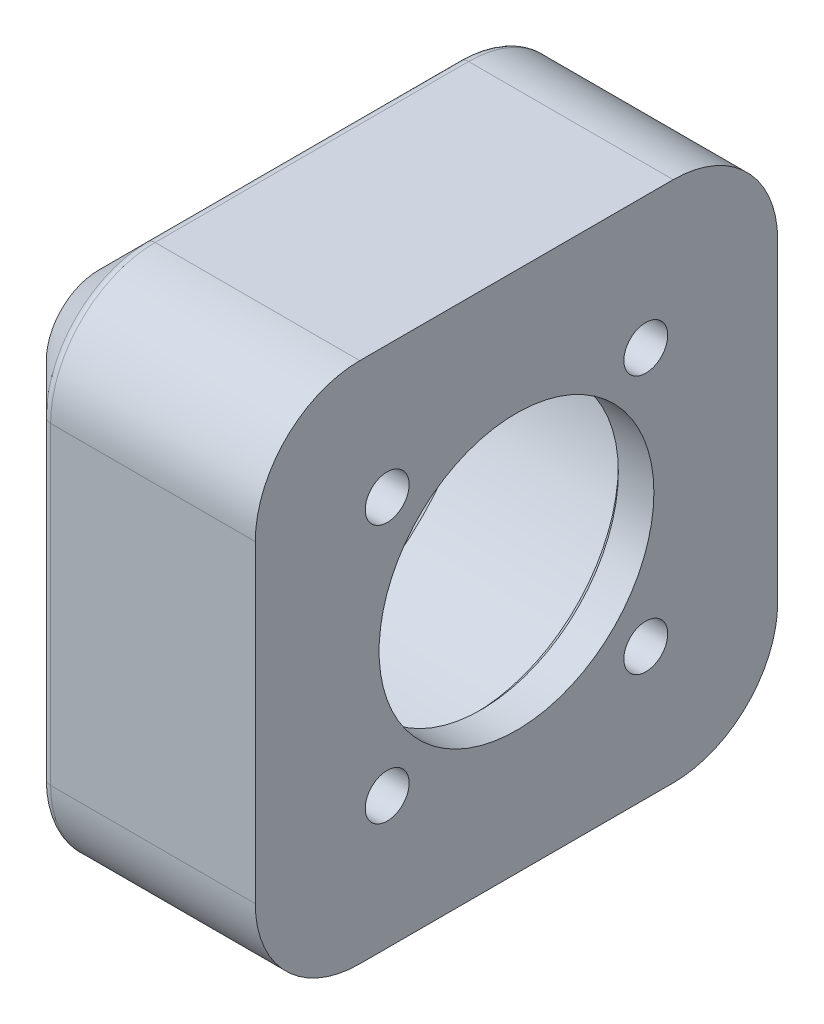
ISO-10303-21;
HEADER;
FILE_DESCRIPTION(('STEP AP214'),'2;1');
FILE_NAME('part.step','',(''),(''),'','','');
FILE_SCHEMA(('AUTOMOTIVE_DESIGN { 1 0 10303 214 1 1 1 1 }'));
ENDSEC;
DATA;
#1=APPLICATION_CONTEXT('core data for automotive mechanical design processes');
#2=APPLICATION_PROTOCOL_DEFINITION('international standard','automotive_design',2000,#1);
#3=PRODUCT_CONTEXT('',#1,'mechanical');
#4=PRODUCT('Part','Part','',(#3));
#5=PRODUCT_RELATED_PRODUCT_CATEGORY('part','',(#4));
#6=PRODUCT_DEFINITION_FORMATION('','',#4);
#7=PRODUCT_DEFINITION_CONTEXT('part definition',#1,'design');
#8=PRODUCT_DEFINITION('design','',#6,#7);
#9=PRODUCT_DEFINITION_SHAPE('','',#8);
#10=(LENGTH_UNIT() NAMED_UNIT(*) SI_UNIT(.MILLI.,.METRE.));
#11=(NAMED_UNIT(*) PLANE_ANGLE_UNIT() SI_UNIT($,.RADIAN.));
#12=(NAMED_UNIT(*) SI_UNIT($,.STERADIAN.) SOLID_ANGLE_UNIT());
#13=UNCERTAINTY_MEASURE_WITH_UNIT(LENGTH_MEASURE(1.E-05),#10,'distance_accuracy_value','');
#14=(GEOMETRIC_REPRESENTATION_CONTEXT(3) GLOBAL_UNCERTAINTY_ASSIGNED_CONTEXT((#13)) GLOBAL_UNIT_ASSIGNED_CONTEXT((#10,
#11,#12)) REPRESENTATION_CONTEXT('',''));
#15=CARTESIAN_POINT('',(0.,0.,0.));
#16=DIRECTION('',(0.,0.,1.));
#17=DIRECTION('',(1.,0.,0.));
#18=AXIS2_PLACEMENT_3D('',#15,#16,#17);
#19=CARTESIAN_POINT('',(-21.,0.,0.));
#20=DIRECTION('',(1.,0.,0.));
#21=DIRECTION('',(0.,0.,-1.));
#22=AXIS2_PLACEMENT_3D('',#19,#20,#21);
#23=PLANE('',#22);
#24=DIRECTION('',(0.,0.,1.));
#25=VECTOR('',#24,1.);
#26=CARTESIAN_POINT('',(-21.,-20.,0.));
#27=LINE('',#26,#25);
#28=CARTESIAN_POINT('',(-21.,-20.,-15.));
#29=VERTEX_POINT('',#28);
#30=CARTESIAN_POINT('',(-21.,-20.,-9.51958507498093));
#31=VERTEX_POINT('',#30);
#32=EDGE_CURVE('E317',#29,#31,#27,.T.);
#33=ORIENTED_EDGE('',*,*,#32,.T.);
#34=CARTESIAN_POINT('',(-21.,0.,0.));
#35=DIRECTION('',(1.,0.,0.));
#36=DIRECTION('',(0.,0.,-1.));
#37=AXIS2_PLACEMENT_3D('',#34,#35,#36);
#38=CIRCLE('',#37,22.15);
#39=CARTESIAN_POINT('',(-21.,-9.5195850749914,-20.));
#40=VERTEX_POINT('',#39);
#41=EDGE_CURVE('E316',#31,#40,#38,.T.);
#42=ORIENTED_EDGE('',*,*,#41,.T.);
#43=DIRECTION('',(0.,-1.,0.));
#44=VECTOR('',#43,1.);
#45=CARTESIAN_POINT('',(-21.,0.,-20.));
#46=LINE('',#45,#44);
#47=CARTESIAN_POINT('',(-21.,-15.,-20.));
#48=VERTEX_POINT('',#47);
#49=EDGE_CURVE('E311',#40,#48,#46,.T.);
#50=ORIENTED_EDGE('',*,*,#49,.T.);
#51=CARTESIAN_POINT('',(-21.,-15.,-15.));
#52=DIRECTION('',(1.,0.,0.));
#53=DIRECTION('',(0.,0.,-1.));
#54=AXIS2_PLACEMENT_3D('',#51,#52,#53);
#55=CIRCLE('',#54,5.);
#56=EDGE_CURVE('E312',#48,#29,#55,.F.);
#57=ORIENTED_EDGE('',*,*,#56,.T.);
#58=EDGE_LOOP('',(#33,#42,#50,#57));
#59=FACE_BOUND('',#58,.T.);
#60=ADVANCED_FACE('F43',(#59),#23,.F.);
#61=DIRECTION('',(0.,1.,0.));
#62=VECTOR('',#61,1.);
#63=CARTESIAN_POINT('',(-21.,0.,20.));
#64=LINE('',#63,#62);
#65=CARTESIAN_POINT('',(-21.,-15.,20.));
#66=VERTEX_POINT('',#65);
#67=CARTESIAN_POINT('',(-21.,-9.51958507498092,20.));
#68=VERTEX_POINT('',#67);
#69=EDGE_CURVE('E305',#66,#68,#64,.T.);
#70=ORIENTED_EDGE('',*,*,#69,.T.);
#71=CARTESIAN_POINT('',(-21.,0.,0.));
#72=DIRECTION('',(1.,0.,0.));
#73=DIRECTION('',(0.,0.,-1.));
#74=AXIS2_PLACEMENT_3D('',#71,#72,#73);
#75=CIRCLE('',#74,22.15);
#76=CARTESIAN_POINT('',(-21.,-20.,9.5195850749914));
#77=VERTEX_POINT('',#76);
#78=EDGE_CURVE('E645',#68,#77,#75,.T.);
#79=ORIENTED_EDGE('',*,*,#78,.T.);
#80=DIRECTION('',(0.,0.,1.));
#81=VECTOR('',#80,1.);
#82=CARTESIAN_POINT('',(-21.,-20.,0.));
#83=LINE('',#82,#81);
#84=CARTESIAN_POINT('',(-21.,-20.,15.));
#85=VERTEX_POINT('',#84);
#86=EDGE_CURVE('E308',#77,#85,#83,.T.);
#87=ORIENTED_EDGE('',*,*,#86,.T.);
#88=CARTESIAN_POINT('',(-21.,-15.,15.));
#89=DIRECTION('',(1.,0.,0.));
#90=DIRECTION('',(0.,0.,-1.));
#91=AXIS2_PLACEMENT_3D('',#88,#89,#90);
#92=CIRCLE('',#91,5.);
#93=EDGE_CURVE('E304',#85,#66,#92,.F.);
#94=ORIENTED_EDGE('',*,*,#93,.T.);
#95=EDGE_LOOP('',(#70,#79,#87,#94));
#96=FACE_BOUND('',#95,.T.);
#97=ADVANCED_FACE('F874',(#96),#23,.F.);
#98=DIRECTION('',(0.,-1.,0.));
#99=VECTOR('',#98,1.);
#100=CARTESIAN_POINT('',(-21.,0.,-20.));
#101=LINE('',#100,#99);
#102=CARTESIAN_POINT('',(-21.,15.,-20.));
#103=VERTEX_POINT('',#102);
#104=CARTESIAN_POINT('',(-21.,9.51958507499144,-20.));
#105=VERTEX_POINT('',#104);
#106=EDGE_CURVE('E299',#103,#105,#101,.T.);
#107=ORIENTED_EDGE('',*,*,#106,.T.);
#108=CARTESIAN_POINT('',(-21.,0.,0.));
#109=DIRECTION('',(1.,0.,0.));
#110=DIRECTION('',(0.,0.,-1.));
#111=AXIS2_PLACEMENT_3D('',#108,#109,#110);
#112=CIRCLE('',#111,22.15);
#113=CARTESIAN_POINT('',(-21.,20.,-9.51958507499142));
#114=VERTEX_POINT('',#113);
#115=EDGE_CURVE('E731',#105,#114,#112,.T.);
#116=ORIENTED_EDGE('',*,*,#115,.T.);
#117=DIRECTION('',(0.,0.,-1.));
#118=VECTOR('',#117,1.);
#119=CARTESIAN_POINT('',(-21.,20.,0.));
#120=LINE('',#119,#118);
#121=CARTESIAN_POINT('',(-21.,20.,-15.));
#122=VERTEX_POINT('',#121);
#123=EDGE_CURVE('E294',#114,#122,#120,.T.);
#124=ORIENTED_EDGE('',*,*,#123,.T.);
#125=CARTESIAN_POINT('',(-21.,15.,-15.));
#126=DIRECTION('',(1.,0.,0.));
#127=DIRECTION('',(0.,0.,-1.));
#128=AXIS2_PLACEMENT_3D('',#125,#126,#127);
#129=CIRCLE('',#128,5.);
#130=EDGE_CURVE('E300',#122,#103,#129,.F.);
#131=ORIENTED_EDGE('',*,*,#130,.T.);
#132=EDGE_LOOP('',(#107,#116,#124,#131));
#133=FACE_BOUND('',#132,.T.);
#134=ADVANCED_FACE('F728',(#133),#23,.F.);
#135=CARTESIAN_POINT('',(0.,0.,0.));
#136=DIRECTION('',(1.,0.,0.));
#137=DIRECTION('',(0.,0.,-1.));
#138=AXIS2_PLACEMENT_3D('',#135,#136,#137);
#139=PLANE('',#138);
#140=CARTESIAN_POINT('',(0.,0.,0.));
#141=DIRECTION('',(1.,0.,0.));
#142=DIRECTION('',(0.,0.,-1.));
#143=AXIS2_PLACEMENT_3D('',#140,#141,#142);
#144=CIRCLE('',#143,13.75);
#145=CARTESIAN_POINT('',(0.,0.,-13.75));
#146=VERTEX_POINT('',#145);
#147=EDGE_CURVE('E281',#146,#146,#144,.T.);
#148=ORIENTED_EDGE('',*,*,#147,.T.);
#149=EDGE_LOOP('',(#148));
#150=FACE_BOUND('',#149,.T.);
#151=CARTESIAN_POINT('',(0.,12.3743686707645,-12.3743686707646));
#152=DIRECTION('',(1.,0.,0.));
#153=DIRECTION('',(0.,0.,-1.));
#154=AXIS2_PLACEMENT_3D('',#151,#152,#153);
#155=CIRCLE('',#154,2.1);
#156=CARTESIAN_POINT('',(0.,12.3743686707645,-14.4743686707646));
#157=VERTEX_POINT('',#156);
#158=EDGE_CURVE('E950',#157,#157,#155,.T.);
#159=ORIENTED_EDGE('',*,*,#158,.T.);
#160=EDGE_LOOP('',(#159));
#161=FACE_BOUND('',#160,.T.);
#162=CARTESIAN_POINT('',(0.,-12.3743686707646,-12.3743686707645));
#163=DIRECTION('',(1.,0.,0.));
#164=DIRECTION('',(0.,0.,-1.));
#165=AXIS2_PLACEMENT_3D('',#162,#163,#164);
#166=CIRCLE('',#165,2.1);
#167=CARTESIAN_POINT('',(0.,-12.3743686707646,-14.4743686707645));
#168=VERTEX_POINT('',#167);
#169=EDGE_CURVE('E945',#168,#168,#166,.T.);
#170=ORIENTED_EDGE('',*,*,#169,.T.);
#171=EDGE_LOOP('',(#170));
#172=FACE_BOUND('',#171,.T.);
#173=CARTESIAN_POINT('',(0.,-12.3743686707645,12.3743686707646));
#174=DIRECTION('',(1.,0.,0.));
#175=DIRECTION('',(0.,0.,-1.));
#176=AXIS2_PLACEMENT_3D('',#173,#174,#175);
#177=CIRCLE('',#176,2.1);
#178=CARTESIAN_POINT('',(0.,-12.3743686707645,10.2743686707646));
#179=VERTEX_POINT('',#178);
#180=EDGE_CURVE('E951',#179,#179,#177,.T.);
#181=ORIENTED_EDGE('',*,*,#180,.T.);
#182=EDGE_LOOP('',(#181));
#183=FACE_BOUND('',#182,.T.);
#184=CARTESIAN_POINT('',(0.,12.3743686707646,12.3743686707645));
#185=DIRECTION('',(1.,0.,0.));
#186=DIRECTION('',(0.,0.,-1.));
#187=AXIS2_PLACEMENT_3D('',#184,#185,#186);
#188=CIRCLE('',#187,2.1);
#189=CARTESIAN_POINT('',(0.,12.3743686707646,10.2743686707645));
#190=VERTEX_POINT('',#189);
#191=EDGE_CURVE('E960',#190,#190,#188,.T.);
#192=ORIENTED_EDGE('',*,*,#191,.T.);
#193=EDGE_LOOP('',(#192));
#194=FACE_BOUND('',#193,.T.);
#195=CARTESIAN_POINT('',(0.,0.,0.));
#196=DIRECTION('',(1.,0.,0.));
#197=DIRECTION('',(0.,0.,-1.));
#198=AXIS2_PLACEMENT_3D('',#195,#196,#197);
#199=CIRCLE('',#198,21.15);
#200=CARTESIAN_POINT('',(0.,0.,-21.15));
#201=VERTEX_POINT('',#200);
#202=EDGE_CURVE('E264',#201,#201,#199,.T.);
#203=ORIENTED_EDGE('',*,*,#202,.F.);
#204=EDGE_LOOP('',(#203));
#205=FACE_BOUND('',#204,.T.);
#206=ADVANCED_FACE('F1023',(#150,#161,#172,#183,#194,#205),#139,.F.);
#207=CARTESIAN_POINT('',(4.,0.,0.));
#208=DIRECTION('',(1.,0.,0.));
#209=DIRECTION('',(0.,0.,-1.));
#210=AXIS2_PLACEMENT_3D('',#207,#208,#209);
#211=PLANE('',#210);
#212=CARTESIAN_POINT('',(4.,12.3743686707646,12.3743686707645));
#213=DIRECTION('',(1.,0.,0.));
#214=DIRECTION('',(0.,0.,-1.));
#215=AXIS2_PLACEMENT_3D('',#212,#213,#214);
#216=CIRCLE('',#215,2.1);
#217=CARTESIAN_POINT('',(4.,12.3743686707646,10.2743686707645));
#218=VERTEX_POINT('',#217);
#219=EDGE_CURVE('E341',#218,#218,#216,.T.);
#220=ORIENTED_EDGE('',*,*,#219,.F.);
#221=EDGE_LOOP('',(#220));
#222=FACE_BOUND('',#221,.T.);
#223=CARTESIAN_POINT('',(4.,-12.3743686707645,12.3743686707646));
#224=DIRECTION('',(1.,0.,0.));
#225=DIRECTION('',(0.,0.,-1.));
#226=AXIS2_PLACEMENT_3D('',#223,#224,#225);
#227=CIRCLE('',#226,2.1);
#228=CARTESIAN_POINT('',(4.,-12.3743686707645,10.2743686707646));
#229=VERTEX_POINT('',#228);
#230=EDGE_CURVE('E952',#229,#229,#227,.T.);
#231=ORIENTED_EDGE('',*,*,#230,.F.);
#232=EDGE_LOOP('',(#231));
#233=FACE_BOUND('',#232,.T.);
#234=CARTESIAN_POINT('',(4.,-12.3743686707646,-12.3743686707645));
#235=DIRECTION('',(1.,0.,0.));
#236=DIRECTION('',(0.,0.,-1.));
#237=AXIS2_PLACEMENT_3D('',#234,#235,#236);
#238=CIRCLE('',#237,2.1);
#239=CARTESIAN_POINT('',(4.,-12.3743686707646,-14.4743686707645));
#240=VERTEX_POINT('',#239);
#241=EDGE_CURVE('E946',#240,#240,#238,.T.);
#242=ORIENTED_EDGE('',*,*,#241,.F.);
#243=EDGE_LOOP('',(#242));
#244=FACE_BOUND('',#243,.T.);
#245=CARTESIAN_POINT('',(4.,12.3743686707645,-12.3743686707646));
#246=DIRECTION('',(1.,0.,0.));
#247=DIRECTION('',(0.,0.,-1.));
#248=AXIS2_PLACEMENT_3D('',#245,#246,#247);
#249=CIRCLE('',#248,2.1);
#250=CARTESIAN_POINT('',(4.,12.3743686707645,-14.4743686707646));
#251=VERTEX_POINT('',#250);
#252=EDGE_CURVE('E965',#251,#251,#249,.T.);
#253=ORIENTED_EDGE('',*,*,#252,.F.);
#254=EDGE_LOOP('',(#253));
#255=FACE_BOUND('',#254,.T.);
#256=DIRECTION('',(0.,0.,-1.));
#257=VECTOR('',#256,1.);
#258=CARTESIAN_POINT('',(4.,-25.,25.));
#259=LINE('',#258,#257);
#260=CARTESIAN_POINT('',(4.,-25.,15.));
#261=VERTEX_POINT('',#260);
#262=CARTESIAN_POINT('',(4.,-25.,-15.));
#263=VERTEX_POINT('',#262);
#264=EDGE_CURVE('E238',#261,#263,#259,.T.);
#265=ORIENTED_EDGE('',*,*,#264,.T.);
#266=CARTESIAN_POINT('',(4.,-15.,-15.));
#267=DIRECTION('',(1.,0.,0.));
#268=DIRECTION('',(0.,0.,-1.));
#269=AXIS2_PLACEMENT_3D('',#266,#267,#268);
#270=CIRCLE('',#269,10.);
#271=CARTESIAN_POINT('',(4.,-15.,-25.));
#272=VERTEX_POINT('',#271);
#273=EDGE_CURVE('E233',#263,#272,#270,.T.);
#274=ORIENTED_EDGE('',*,*,#273,.T.);
#275=DIRECTION('',(0.,1.,0.));
#276=VECTOR('',#275,1.);
#277=CARTESIAN_POINT('',(4.,25.,-25.));
#278=LINE('',#277,#276);
#279=CARTESIAN_POINT('',(4.,15.,-25.));
#280=VERTEX_POINT('',#279);
#281=EDGE_CURVE('E232',#272,#280,#278,.T.);
#282=ORIENTED_EDGE('',*,*,#281,.T.);
#283=CARTESIAN_POINT('',(4.,15.,-15.));
#284=DIRECTION('',(1.,0.,0.));
#285=DIRECTION('',(0.,0.,-1.));
#286=AXIS2_PLACEMENT_3D('',#283,#284,#285);
#287=CIRCLE('',#286,10.);
#288=CARTESIAN_POINT('',(4.,25.,-15.));
#289=VERTEX_POINT('',#288);
#290=EDGE_CURVE('E266',#280,#289,#287,.T.);
#291=ORIENTED_EDGE('',*,*,#290,.T.);
#292=DIRECTION('',(0.,0.,1.));
#293=VECTOR('',#292,1.);
#294=CARTESIAN_POINT('',(4.,25.,25.));
#295=LINE('',#294,#293);
#296=CARTESIAN_POINT('',(4.,25.,15.));
#297=VERTEX_POINT('',#296);
#298=EDGE_CURVE('E255',#289,#297,#295,.T.);
#299=ORIENTED_EDGE('',*,*,#298,.T.);
#300=CARTESIAN_POINT('',(4.,15.,15.));
#301=DIRECTION('',(1.,0.,0.));
#302=DIRECTION('',(0.,0.,-1.));
#303=AXIS2_PLACEMENT_3D('',#300,#301,#302);
#304=CIRCLE('',#303,10.);
#305=CARTESIAN_POINT('',(4.,15.,25.));
#306=VERTEX_POINT('',#305);
#307=EDGE_CURVE('E267',#297,#306,#304,.T.);
#308=ORIENTED_EDGE('',*,*,#307,.T.);
#309=DIRECTION('',(0.,-1.,0.));
#310=VECTOR('',#309,1.);
#311=CARTESIAN_POINT('',(4.,25.,25.));
#312=LINE('',#311,#310);
#313=CARTESIAN_POINT('',(4.,-15.,25.));
#314=VERTEX_POINT('',#313);
#315=EDGE_CURVE('E942',#306,#314,#312,.T.);
#316=ORIENTED_EDGE('',*,*,#315,.T.);
#317=CARTESIAN_POINT('',(4.,-15.,15.));
#318=DIRECTION('',(1.,0.,0.));
#319=DIRECTION('',(0.,0.,-1.));
#320=AXIS2_PLACEMENT_3D('',#317,#318,#319);
#321=CIRCLE('',#320,10.);
#322=EDGE_CURVE('E243',#314,#261,#321,.T.);
#323=ORIENTED_EDGE('',*,*,#322,.T.);
#324=EDGE_LOOP('',(#265,#274,#282,#291,#299,#308,#316,#323));
#325=FACE_BOUND('',#324,.T.);
#326=CARTESIAN_POINT('',(4.,0.,0.));
#327=DIRECTION('',(1.,0.,0.));
#328=DIRECTION('',(0.,0.,-1.));
#329=AXIS2_PLACEMENT_3D('',#326,#327,#328);
#330=CIRCLE('',#329,13.15);
#331=CARTESIAN_POINT('',(4.,0.,-13.15));
#332=VERTEX_POINT('',#331);
#333=EDGE_CURVE('E254',#332,#332,#330,.T.);
#334=ORIENTED_EDGE('',*,*,#333,.F.);
#335=EDGE_LOOP('',(#334));
#336=FACE_BOUND('',#335,.T.);
#337=ADVANCED_FACE('F231',(#222,#233,#244,#255,#325,#336),#211,.T.);
#338=CARTESIAN_POINT('',(4.,25.,-25.));
#339=DIRECTION('',(0.,0.,1.));
#340=DIRECTION('',(0.,-1.,0.));
#341=AXIS2_PLACEMENT_3D('',#338,#339,#340);
#342=PLANE('',#341);
#343=DIRECTION('',(-1.,0.,0.));
#344=VECTOR('',#343,1.);
#345=CARTESIAN_POINT('',(4.,-15.,-25.));
#346=LINE('',#345,#344);
#347=CARTESIAN_POINT('',(-15.5857864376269,-15.,-25.));
#348=VERTEX_POINT('',#347);
#349=EDGE_CURVE('E247',#272,#348,#346,.T.);
#350=ORIENTED_EDGE('',*,*,#349,.T.);
#351=DIRECTION('',(0.,-1.,0.));
#352=VECTOR('',#351,1.);
#353=CARTESIAN_POINT('',(-15.5857864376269,15.,-25.));
#354=LINE('',#353,#352);
#355=CARTESIAN_POINT('',(-15.5857864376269,15.,-25.));
#356=VERTEX_POINT('',#355);
#357=EDGE_CURVE('E794',#348,#356,#354,.F.);
#358=ORIENTED_EDGE('',*,*,#357,.T.);
#359=DIRECTION('',(-1.,0.,0.));
#360=VECTOR('',#359,1.);
#361=CARTESIAN_POINT('',(4.,15.,-25.));
#362=LINE('',#361,#360);
#363=EDGE_CURVE('E252',#356,#280,#362,.F.);
#364=ORIENTED_EDGE('',*,*,#363,.T.);
#365=ORIENTED_EDGE('',*,*,#281,.F.);
#366=EDGE_LOOP('',(#350,#358,#364,#365));
#367=FACE_BOUND('',#366,.T.);
#368=ADVANCED_FACE('F250',(#367),#342,.F.);
#369=CARTESIAN_POINT('',(4.,25.,25.));
#370=DIRECTION('',(0.,-1.,0.));
#371=DIRECTION('',(0.,0.,-1.));
#372=AXIS2_PLACEMENT_3D('',#369,#370,#371);
#373=PLANE('',#372);
#374=DIRECTION('',(-1.,0.,0.));
#375=VECTOR('',#374,1.);
#376=CARTESIAN_POINT('',(4.,25.,-15.));
#377=LINE('',#376,#375);
#378=CARTESIAN_POINT('',(-15.5857864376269,25.,-15.));
#379=VERTEX_POINT('',#378);
#380=EDGE_CURVE('E277',#289,#379,#377,.T.);
#381=ORIENTED_EDGE('',*,*,#380,.T.);
#382=DIRECTION('',(0.,0.,-1.));
#383=VECTOR('',#382,1.);
#384=CARTESIAN_POINT('',(-15.5857864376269,25.,15.));
#385=LINE('',#384,#383);
#386=CARTESIAN_POINT('',(-15.5857864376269,25.,15.));
#387=VERTEX_POINT('',#386);
#388=EDGE_CURVE('E802',#379,#387,#385,.F.);
#389=ORIENTED_EDGE('',*,*,#388,.T.);
#390=DIRECTION('',(-1.,0.,0.));
#391=VECTOR('',#390,1.);
#392=CARTESIAN_POINT('',(4.,25.,15.));
#393=LINE('',#392,#391);
#394=EDGE_CURVE('E276',#387,#297,#393,.F.);
#395=ORIENTED_EDGE('',*,*,#394,.T.);
#396=ORIENTED_EDGE('',*,*,#298,.F.);
#397=EDGE_LOOP('',(#381,#389,#395,#396));
#398=FACE_BOUND('',#397,.T.);
#399=ADVANCED_FACE('F994',(#398),#373,.F.);
#400=CARTESIAN_POINT('',(4.,25.,25.));
#401=DIRECTION('',(0.,0.,-1.));
#402=DIRECTION('',(0.,1.,0.));
#403=AXIS2_PLACEMENT_3D('',#400,#401,#402);
#404=PLANE('',#403);
#405=DIRECTION('',(-1.,0.,0.));
#406=VECTOR('',#405,1.);
#407=CARTESIAN_POINT('',(4.,15.,25.));
#408=LINE('',#407,#406);
#409=CARTESIAN_POINT('',(-15.5857864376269,15.,25.));
#410=VERTEX_POINT('',#409);
#411=EDGE_CURVE('E245',#306,#410,#408,.T.);
#412=ORIENTED_EDGE('',*,*,#411,.T.);
#413=DIRECTION('',(0.,1.,0.));
#414=VECTOR('',#413,1.);
#415=CARTESIAN_POINT('',(-15.5857864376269,-15.,25.));
#416=LINE('',#415,#414);
#417=CARTESIAN_POINT('',(-15.5857864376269,-15.,25.));
#418=VERTEX_POINT('',#417);
#419=EDGE_CURVE('E55',#410,#418,#416,.F.);
#420=ORIENTED_EDGE('',*,*,#419,.T.);
#421=DIRECTION('',(-1.,0.,0.));
#422=VECTOR('',#421,1.);
#423=CARTESIAN_POINT('',(4.,-15.,25.));
#424=LINE('',#423,#422);
#425=EDGE_CURVE('E274',#418,#314,#424,.F.);
#426=ORIENTED_EDGE('',*,*,#425,.T.);
#427=ORIENTED_EDGE('',*,*,#315,.F.);
#428=EDGE_LOOP('',(#412,#420,#426,#427));
#429=FACE_BOUND('',#428,.T.);
#430=ADVANCED_FACE('F1041',(#429),#404,.F.);
#431=CARTESIAN_POINT('',(4.,-25.,25.));
#432=DIRECTION('',(0.,1.,0.));
#433=DIRECTION('',(0.,0.,1.));
#434=AXIS2_PLACEMENT_3D('',#431,#432,#433);
#435=PLANE('',#434);
#436=DIRECTION('',(-1.,0.,0.));
#437=VECTOR('',#436,1.);
#438=CARTESIAN_POINT('',(4.,-25.,15.));
#439=LINE('',#438,#437);
#440=CARTESIAN_POINT('',(-15.5857864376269,-25.,15.));
#441=VERTEX_POINT('',#440);
#442=EDGE_CURVE('E257',#261,#441,#439,.T.);
#443=ORIENTED_EDGE('',*,*,#442,.T.);
#444=DIRECTION('',(0.,0.,1.));
#445=VECTOR('',#444,1.);
#446=CARTESIAN_POINT('',(-15.5857864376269,-25.,-15.));
#447=LINE('',#446,#445);
#448=CARTESIAN_POINT('',(-15.5857864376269,-25.,-15.));
#449=VERTEX_POINT('',#448);
#450=EDGE_CURVE('E789',#441,#449,#447,.F.);
#451=ORIENTED_EDGE('',*,*,#450,.T.);
#452=DIRECTION('',(-1.,0.,0.));
#453=VECTOR('',#452,1.);
#454=CARTESIAN_POINT('',(4.,-25.,-15.));
#455=LINE('',#454,#453);
#456=EDGE_CURVE('E261',#449,#263,#455,.F.);
#457=ORIENTED_EDGE('',*,*,#456,.T.);
#458=ORIENTED_EDGE('',*,*,#264,.F.);
#459=EDGE_LOOP('',(#443,#451,#457,#458));
#460=FACE_BOUND('',#459,.T.);
#461=ADVANCED_FACE('F980',(#460),#435,.F.);
#462=CARTESIAN_POINT('',(4.,0.,0.));
#463=DIRECTION('',(-1.,0.,0.));
#464=DIRECTION('',(0.,0.,1.));
#465=AXIS2_PLACEMENT_3D('',#462,#463,#464);
#466=CYLINDRICAL_SURFACE('',#465,13.15);
#467=CARTESIAN_POINT('',(0.600000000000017,0.,0.));
#468=DIRECTION('',(1.,0.,0.));
#469=DIRECTION('',(0.,0.,-1.));
#470=AXIS2_PLACEMENT_3D('',#467,#468,#469);
#471=CIRCLE('',#470,13.15);
#472=CARTESIAN_POINT('',(0.600000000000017,0.,-13.15));
#473=VERTEX_POINT('',#472);
#474=EDGE_CURVE('E283',#473,#473,#471,.F.);
#475=ORIENTED_EDGE('',*,*,#474,.T.);
#476=EDGE_LOOP('',(#475));
#477=FACE_BOUND('',#476,.T.);
#478=ORIENTED_EDGE('',*,*,#333,.T.);
#479=EDGE_LOOP('',(#478));
#480=FACE_BOUND('',#479,.T.);
#481=ADVANCED_FACE('F1039',(#477,#480),#466,.F.);
#482=CARTESIAN_POINT('',(4.,12.3743686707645,-12.3743686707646));
#483=DIRECTION('',(-1.,0.,0.));
#484=DIRECTION('',(0.,0.,1.));
#485=AXIS2_PLACEMENT_3D('',#482,#483,#484);
#486=CYLINDRICAL_SURFACE('',#485,2.1);
#487=ORIENTED_EDGE('',*,*,#252,.T.);
#488=EDGE_LOOP('',(#487));
#489=FACE_BOUND('',#488,.T.);
#490=ORIENTED_EDGE('',*,*,#158,.F.);
#491=EDGE_LOOP('',(#490));
#492=FACE_BOUND('',#491,.T.);
#493=ADVANCED_FACE('F1229',(#489,#492),#486,.F.);
#494=CARTESIAN_POINT('',(4.,-12.3743686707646,-12.3743686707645));
#495=DIRECTION('',(-1.,0.,0.));
#496=DIRECTION('',(0.,0.,1.));
#497=AXIS2_PLACEMENT_3D('',#494,#495,#496);
#498=CYLINDRICAL_SURFACE('',#497,2.1);
#499=ORIENTED_EDGE('',*,*,#241,.T.);
#500=EDGE_LOOP('',(#499));
#501=FACE_BOUND('',#500,.T.);
#502=ORIENTED_EDGE('',*,*,#169,.F.);
#503=EDGE_LOOP('',(#502));
#504=FACE_BOUND('',#503,.T.);
#505=ADVANCED_FACE('F1217',(#501,#504),#498,.F.);
#506=CARTESIAN_POINT('',(4.,-12.3743686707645,12.3743686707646));
#507=DIRECTION('',(-1.,0.,0.));
#508=DIRECTION('',(0.,0.,1.));
#509=AXIS2_PLACEMENT_3D('',#506,#507,#508);
#510=CYLINDRICAL_SURFACE('',#509,2.1);
#511=ORIENTED_EDGE('',*,*,#230,.T.);
#512=EDGE_LOOP('',(#511));
#513=FACE_BOUND('',#512,.T.);
#514=ORIENTED_EDGE('',*,*,#180,.F.);
#515=EDGE_LOOP('',(#514));
#516=FACE_BOUND('',#515,.T.);
#517=ADVANCED_FACE('F1019',(#513,#516),#510,.F.);
#518=CARTESIAN_POINT('',(4.,12.3743686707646,12.3743686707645));
#519=DIRECTION('',(-1.,0.,0.));
#520=DIRECTION('',(0.,0.,1.));
#521=AXIS2_PLACEMENT_3D('',#518,#519,#520);
#522=CYLINDRICAL_SURFACE('',#521,2.1);
#523=ORIENTED_EDGE('',*,*,#219,.T.);
#524=EDGE_LOOP('',(#523));
#525=FACE_BOUND('',#524,.T.);
#526=ORIENTED_EDGE('',*,*,#191,.F.);
#527=EDGE_LOOP('',(#526));
#528=FACE_BOUND('',#527,.T.);
#529=ADVANCED_FACE('F1012',(#525,#528),#522,.F.);
#530=DIRECTION('',(0.,0.,-1.));
#531=VECTOR('',#530,1.);
#532=CARTESIAN_POINT('',(-21.,20.,0.));
#533=LINE('',#532,#531);
#534=CARTESIAN_POINT('',(-21.,20.,15.));
#535=VERTEX_POINT('',#534);
#536=CARTESIAN_POINT('',(-21.,20.,9.51958507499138));
#537=VERTEX_POINT('',#536);
#538=EDGE_CURVE('E290',#535,#537,#533,.T.);
#539=ORIENTED_EDGE('',*,*,#538,.T.);
#540=CARTESIAN_POINT('',(-21.,0.,0.));
#541=DIRECTION('',(1.,0.,0.));
#542=DIRECTION('',(0.,0.,-1.));
#543=AXIS2_PLACEMENT_3D('',#540,#541,#542);
#544=CIRCLE('',#543,22.15);
#545=CARTESIAN_POINT('',(-21.,9.51958507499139,20.));
#546=VERTEX_POINT('',#545);
#547=EDGE_CURVE('E897',#537,#546,#544,.T.);
#548=ORIENTED_EDGE('',*,*,#547,.T.);
#549=DIRECTION('',(0.,1.,0.));
#550=VECTOR('',#549,1.);
#551=CARTESIAN_POINT('',(-21.,0.,20.));
#552=LINE('',#551,#550);
#553=CARTESIAN_POINT('',(-21.,15.,20.));
#554=VERTEX_POINT('',#553);
#555=EDGE_CURVE('E292',#546,#554,#552,.T.);
#556=ORIENTED_EDGE('',*,*,#555,.T.);
#557=CARTESIAN_POINT('',(-21.,15.,15.));
#558=DIRECTION('',(1.,0.,0.));
#559=DIRECTION('',(0.,0.,-1.));
#560=AXIS2_PLACEMENT_3D('',#557,#558,#559);
#561=CIRCLE('',#560,5.);
#562=EDGE_CURVE('E289',#554,#535,#561,.F.);
#563=ORIENTED_EDGE('',*,*,#562,.T.);
#564=EDGE_LOOP('',(#539,#548,#556,#563));
#565=FACE_BOUND('',#564,.T.);
#566=ADVANCED_FACE('F689',(#565),#23,.F.);
#567=CARTESIAN_POINT('',(-21.,0.,0.));
#568=DIRECTION('',(1.,0.,0.));
#569=DIRECTION('',(0.,0.,-1.));
#570=AXIS2_PLACEMENT_3D('',#567,#568,#569);
#571=CYLINDRICAL_SURFACE('',#570,21.15);
#572=CARTESIAN_POINT('',(-21.3832018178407,-9.32736742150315,-18.9821683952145));
#573=CARTESIAN_POINT('',(-21.0163201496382,-8.60490398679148,-19.3371809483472));
#574=CARTESIAN_POINT('',(-20.6921316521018,-7.86214499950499,-19.6508815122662));
#575=CARTESIAN_POINT('',(-20.2730042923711,-6.72482996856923,-20.0564495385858));
#576=CARTESIAN_POINT('',(-20.1444822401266,-6.34186517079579,-20.1808137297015));
#577=CARTESIAN_POINT('',(-19.9102292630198,-5.56946295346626,-20.4074883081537));
#578=CARTESIAN_POINT('',(-19.8044986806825,-5.18002584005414,-20.5097983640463));
#579=CARTESIAN_POINT('',(-19.6161737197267,-4.39594809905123,-20.6920307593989));
#580=CARTESIAN_POINT('',(-19.5335793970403,-4.00130770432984,-20.7719530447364));
#581=CARTESIAN_POINT('',(-19.391796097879,-3.20810931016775,-20.9091494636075));
#582=CARTESIAN_POINT('',(-19.3326071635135,-2.80955154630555,-20.9664235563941));
#583=CARTESIAN_POINT('',(-19.2378275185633,-2.00981708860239,-21.0581369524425));
#584=CARTESIAN_POINT('',(-19.202236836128,-1.60864063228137,-21.0925762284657));
#585=CARTESIAN_POINT('',(-19.1547696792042,-0.80497599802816,-21.1385077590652));
#586=CARTESIAN_POINT('',(-19.1428932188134,-0.402488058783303,-21.15));
#587=CARTESIAN_POINT('',(-19.1428932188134,0.402488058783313,-21.15));
#588=CARTESIAN_POINT('',(-19.1547696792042,0.804975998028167,-21.1385077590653));
#589=CARTESIAN_POINT('',(-19.202236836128,1.60864063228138,-21.0925762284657));
#590=CARTESIAN_POINT('',(-19.2378275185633,2.00981708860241,-21.0581369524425));
#591=CARTESIAN_POINT('',(-19.3326071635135,2.80955154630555,-20.966423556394));
#592=CARTESIAN_POINT('',(-19.391796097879,3.20810931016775,-20.9091494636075));
#593=CARTESIAN_POINT('',(-19.5335793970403,4.00130770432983,-20.7719530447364));
#594=CARTESIAN_POINT('',(-19.6161737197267,4.39594809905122,-20.6920307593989));
#595=CARTESIAN_POINT('',(-19.8044986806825,5.18002584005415,-20.5097983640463));
#596=CARTESIAN_POINT('',(-19.9102292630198,5.56946295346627,-20.4074883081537));
#597=CARTESIAN_POINT('',(-20.1444822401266,6.3418651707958,-20.1808137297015));
#598=CARTESIAN_POINT('',(-20.2730042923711,6.72482996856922,-20.0564495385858));
#599=CARTESIAN_POINT('',(-20.6921316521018,7.86214499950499,-19.6508815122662));
#600=CARTESIAN_POINT('',(-21.0163201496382,8.60490398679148,-19.3371809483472));
#601=CARTESIAN_POINT('',(-21.3832018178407,9.32736742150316,-18.9821683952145));
#602=B_SPLINE_CURVE_WITH_KNOTS('',3,(#572,#573,#574,#575,#576,#577,#578,#579,#580,#581,#582,
#583,#584,#585,#586,#587,#588,#589,#590,#591,#592,#593,#594,#595,#596,#597,#598,#599,#600,#601),
.UNSPECIFIED.,.F.,.F.,(4,2,2,2,2,2,2,2,2,2,2,2,2,2,4),(-0.456724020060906,-0.342543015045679,
-0.285452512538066,-0.228362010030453,-0.17127150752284,-0.114181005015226,-0.0570905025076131,
0.,0.0570905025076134,0.114181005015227,0.17127150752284,0.228362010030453,0.285452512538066,
0.34254301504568,0.456724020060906),.UNSPECIFIED.);
#603=CARTESIAN_POINT('',(-20.,5.86471060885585,-20.3206217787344));
#604=VERTEX_POINT('',#603);
#605=CARTESIAN_POINT('',(-20.0000000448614,-5.86471060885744,-20.3206217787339));
#606=VERTEX_POINT('',#605);
#607=EDGE_CURVE('E453',#604,#606,#602,.F.);
#608=ORIENTED_EDGE('',*,*,#607,.T.);
#609=CARTESIAN_POINT('',(-20.,0.,0.));
#610=DIRECTION('',(1.,0.,0.));
#611=DIRECTION('',(0.,0.,-1.));
#612=AXIS2_PLACEMENT_3D('',#609,#610,#611);
#613=CIRCLE('',#612,21.15);
#614=CARTESIAN_POINT('',(-20.0000000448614,-20.3206217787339,-5.86471060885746));
#615=VERTEX_POINT('',#614);
#616=EDGE_CURVE('E656',#606,#615,#613,.F.);
#617=ORIENTED_EDGE('',*,*,#616,.T.);
#618=CARTESIAN_POINT('',(-21.3832018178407,-18.9821683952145,9.32736742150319));
#619=CARTESIAN_POINT('',(-21.0163201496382,-19.3371809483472,8.60490398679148));
#620=CARTESIAN_POINT('',(-20.6921316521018,-19.6508815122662,7.86214499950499));
#621=CARTESIAN_POINT('',(-20.2730042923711,-20.0564495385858,6.72482996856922));
#622=CARTESIAN_POINT('',(-20.1444822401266,-20.1808137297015,6.3418651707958));
#623=CARTESIAN_POINT('',(-19.9102292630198,-20.4074883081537,5.56946295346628));
#624=CARTESIAN_POINT('',(-19.8044986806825,-20.5097983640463,5.18002584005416));
#625=CARTESIAN_POINT('',(-19.6161737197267,-20.6920307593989,4.39594809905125));
#626=CARTESIAN_POINT('',(-19.5335793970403,-20.7719530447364,4.00130770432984));
#627=CARTESIAN_POINT('',(-19.391796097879,-20.9091494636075,3.20810931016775));
#628=CARTESIAN_POINT('',(-19.3326071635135,-20.966423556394,2.80955154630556));
#629=CARTESIAN_POINT('',(-19.2378275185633,-21.0581369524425,2.00981708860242));
#630=CARTESIAN_POINT('',(-19.202236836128,-21.0925762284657,1.60864063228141));
#631=CARTESIAN_POINT('',(-19.1547696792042,-21.1385077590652,0.804975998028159));
#632=CARTESIAN_POINT('',(-19.1428932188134,-21.15,0.402488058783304));
#633=CARTESIAN_POINT('',(-19.1428932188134,-21.15,-0.402488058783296));
#634=CARTESIAN_POINT('',(-19.1547696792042,-21.1385077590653,-0.804975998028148));
#635=CARTESIAN_POINT('',(-19.202236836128,-21.0925762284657,-1.60864063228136));
#636=CARTESIAN_POINT('',(-19.2378275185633,-21.0581369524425,-2.0098170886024));
#637=CARTESIAN_POINT('',(-19.3326071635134,-20.9664235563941,-2.80955154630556));
#638=CARTESIAN_POINT('',(-19.391796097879,-20.9091494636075,-3.20810931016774));
#639=CARTESIAN_POINT('',(-19.5335793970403,-20.7719530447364,-4.00130770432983));
#640=CARTESIAN_POINT('',(-19.6161737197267,-20.6920307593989,-4.39594809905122));
#641=CARTESIAN_POINT('',(-19.8044986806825,-20.5097983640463,-5.18002584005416));
#642=CARTESIAN_POINT('',(-19.9102292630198,-20.4074883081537,-5.56946295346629));
#643=CARTESIAN_POINT('',(-20.1444822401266,-20.1808137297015,-6.34186517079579));
#644=CARTESIAN_POINT('',(-20.2730042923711,-20.0564495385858,-6.72482996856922));
#645=CARTESIAN_POINT('',(-20.6921316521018,-19.6508815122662,-7.86214499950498));
#646=CARTESIAN_POINT('',(-21.0163201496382,-19.3371809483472,-8.6049039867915));
#647=CARTESIAN_POINT('',(-21.3832018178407,-18.9821683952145,-9.32736742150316));
#648=B_SPLINE_CURVE_WITH_KNOTS('',3,(#618,#619,#620,#621,#622,#623,#624,#625,#626,#627,#628,
#629,#630,#631,#632,#633,#634,#635,#636,#637,#638,#639,#640,#641,#642,#643,#644,#645,#646,#647),
.UNSPECIFIED.,.F.,.F.,(4,2,2,2,2,2,2,2,2,2,2,2,2,2,4),(-0.456724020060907,-0.34254301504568,
-0.285452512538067,-0.228362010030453,-0.17127150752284,-0.114181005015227,-0.0570905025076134,
0.,0.0570905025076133,0.114181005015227,0.17127150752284,0.228362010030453,0.285452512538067,
0.34254301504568,0.456724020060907),.UNSPECIFIED.);
#649=CARTESIAN_POINT('',(-20.,-20.3206217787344,5.8647106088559));
#650=VERTEX_POINT('',#649);
#651=EDGE_CURVE('E715',#615,#650,#648,.F.);
#652=ORIENTED_EDGE('',*,*,#651,.T.);
#653=CARTESIAN_POINT('',(-20.,0.,0.));
#654=DIRECTION('',(1.,0.,0.));
#655=DIRECTION('',(0.,0.,-1.));
#656=AXIS2_PLACEMENT_3D('',#653,#654,#655);
#657=CIRCLE('',#656,21.15);
#658=CARTESIAN_POINT('',(-20.0000000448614,-5.86471060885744,20.3206217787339));
#659=VERTEX_POINT('',#658);
#660=EDGE_CURVE('E714',#650,#659,#657,.F.);
#661=ORIENTED_EDGE('',*,*,#660,.T.);
#662=CARTESIAN_POINT('',(-21.3832018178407,9.32736742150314,18.9821683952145));
#663=CARTESIAN_POINT('',(-21.0163201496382,8.60490398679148,19.3371809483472));
#664=CARTESIAN_POINT('',(-20.6921316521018,7.86214499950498,19.6508815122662));
#665=CARTESIAN_POINT('',(-20.2730042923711,6.72482996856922,20.0564495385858));
#666=CARTESIAN_POINT('',(-20.1444822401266,6.34186517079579,20.1808137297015));
#667=CARTESIAN_POINT('',(-19.9102292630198,5.56946295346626,20.4074883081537));
#668=CARTESIAN_POINT('',(-19.8044986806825,5.18002584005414,20.5097983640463));
#669=CARTESIAN_POINT('',(-19.6161737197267,4.39594809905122,20.6920307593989));
#670=CARTESIAN_POINT('',(-19.5335793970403,4.00130770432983,20.7719530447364));
#671=CARTESIAN_POINT('',(-19.391796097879,3.20810931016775,20.9091494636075));
#672=CARTESIAN_POINT('',(-19.3326071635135,2.80955154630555,20.9664235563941));
#673=CARTESIAN_POINT('',(-19.2378275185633,2.00981708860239,21.0581369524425));
#674=CARTESIAN_POINT('',(-19.202236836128,1.60864063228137,21.0925762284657));
#675=CARTESIAN_POINT('',(-19.1547696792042,0.80497599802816,21.1385077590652));
#676=CARTESIAN_POINT('',(-19.1428932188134,0.402488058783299,21.15));
#677=CARTESIAN_POINT('',(-19.1428932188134,-0.402488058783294,21.15));
#678=CARTESIAN_POINT('',(-19.1547696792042,-0.80497599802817,21.1385077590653));
#679=CARTESIAN_POINT('',(-19.202236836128,-1.60864063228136,21.0925762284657));
#680=CARTESIAN_POINT('',(-19.2378275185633,-2.0098170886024,21.0581369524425));
#681=CARTESIAN_POINT('',(-19.3326071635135,-2.80955154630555,20.9664235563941));
#682=CARTESIAN_POINT('',(-19.391796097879,-3.20810931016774,20.9091494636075));
#683=CARTESIAN_POINT('',(-19.5335793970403,-4.00130770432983,20.7719530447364));
#684=CARTESIAN_POINT('',(-19.6161737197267,-4.39594809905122,20.6920307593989));
#685=CARTESIAN_POINT('',(-19.8044986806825,-5.18002584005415,20.5097983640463));
#686=CARTESIAN_POINT('',(-19.9102292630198,-5.56946295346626,20.4074883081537));
#687=CARTESIAN_POINT('',(-20.1444822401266,-6.34186517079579,20.1808137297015));
#688=CARTESIAN_POINT('',(-20.2730042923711,-6.72482996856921,20.0564495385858));
#689=CARTESIAN_POINT('',(-20.6921316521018,-7.86214499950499,19.6508815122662));
#690=CARTESIAN_POINT('',(-21.0163201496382,-8.60490398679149,19.3371809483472));
#691=CARTESIAN_POINT('',(-21.3832018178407,-9.32736742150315,18.9821683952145));
#692=B_SPLINE_CURVE_WITH_KNOTS('',3,(#662,#663,#664,#665,#666,#667,#668,#669,#670,#671,#672,
#673,#674,#675,#676,#677,#678,#679,#680,#681,#682,#683,#684,#685,#686,#687,#688,#689,#690,#691),
.UNSPECIFIED.,.F.,.F.,(4,2,2,2,2,2,2,2,2,2,2,2,2,2,4),(-0.456724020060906,-0.342543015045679,
-0.285452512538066,-0.228362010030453,-0.17127150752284,-0.114181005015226,-0.0570905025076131,
0.,0.0570905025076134,0.114181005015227,0.17127150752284,0.228362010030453,0.285452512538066,
0.34254301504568,0.456724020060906),.UNSPECIFIED.);
#693=CARTESIAN_POINT('',(-20.,5.86471060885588,20.3206217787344));
#694=VERTEX_POINT('',#693);
#695=EDGE_CURVE('E716',#659,#694,#692,.F.);
#696=ORIENTED_EDGE('',*,*,#695,.T.);
#697=CARTESIAN_POINT('',(-20.,0.,0.));
#698=DIRECTION('',(1.,0.,0.));
#699=DIRECTION('',(0.,0.,-1.));
#700=AXIS2_PLACEMENT_3D('',#697,#698,#699);
#701=CIRCLE('',#700,21.15);
#702=CARTESIAN_POINT('',(-20.0000000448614,20.3206217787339,5.86471060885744));
#703=VERTEX_POINT('',#702);
#704=EDGE_CURVE('E719',#694,#703,#701,.F.);
#705=ORIENTED_EDGE('',*,*,#704,.T.);
#706=CARTESIAN_POINT('',(-21.3832018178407,18.9821683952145,-9.32736742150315));
#707=CARTESIAN_POINT('',(-21.0163201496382,19.3371809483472,-8.60490398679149));
#708=CARTESIAN_POINT('',(-20.6921316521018,19.6508815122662,-7.86214499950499));
#709=CARTESIAN_POINT('',(-20.2730042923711,20.0564495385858,-6.72482996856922));
#710=CARTESIAN_POINT('',(-20.1444822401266,20.1808137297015,-6.34186517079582));
#711=CARTESIAN_POINT('',(-19.9102292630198,20.4074883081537,-5.56946295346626));
#712=CARTESIAN_POINT('',(-19.8044986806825,20.5097983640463,-5.18002584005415));
#713=CARTESIAN_POINT('',(-19.6161737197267,20.6920307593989,-4.39594809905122));
#714=CARTESIAN_POINT('',(-19.5335793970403,20.7719530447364,-4.00130770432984));
#715=CARTESIAN_POINT('',(-19.391796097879,20.9091494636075,-3.20810931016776));
#716=CARTESIAN_POINT('',(-19.3326071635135,20.9664235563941,-2.80955154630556));
#717=CARTESIAN_POINT('',(-19.2378275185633,21.0581369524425,-2.00981708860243));
#718=CARTESIAN_POINT('',(-19.202236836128,21.0925762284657,-1.60864063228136));
#719=CARTESIAN_POINT('',(-19.1547696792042,21.1385077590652,-0.804975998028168));
#720=CARTESIAN_POINT('',(-19.1428932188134,21.15,-0.402488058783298));
#721=CARTESIAN_POINT('',(-19.1428932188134,21.15,0.402488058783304));
#722=CARTESIAN_POINT('',(-19.1547696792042,21.1385077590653,0.80497599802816));
#723=CARTESIAN_POINT('',(-19.202236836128,21.0925762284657,1.60864063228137));
#724=CARTESIAN_POINT('',(-19.2378275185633,21.0581369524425,2.0098170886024));
#725=CARTESIAN_POINT('',(-19.3326071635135,20.9664235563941,2.80955154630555));
#726=CARTESIAN_POINT('',(-19.391796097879,20.9091494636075,3.20810931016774));
#727=CARTESIAN_POINT('',(-19.5335793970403,20.7719530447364,4.00130770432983));
#728=CARTESIAN_POINT('',(-19.6161737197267,20.6920307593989,4.39594809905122));
#729=CARTESIAN_POINT('',(-19.8044986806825,20.5097983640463,5.18002584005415));
#730=CARTESIAN_POINT('',(-19.9102292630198,20.4074883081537,5.56946295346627));
#731=CARTESIAN_POINT('',(-20.1444822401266,20.1808137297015,6.34186517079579));
#732=CARTESIAN_POINT('',(-20.2730042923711,20.0564495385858,6.72482996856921));
#733=CARTESIAN_POINT('',(-20.6921316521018,19.6508815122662,7.86214499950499));
#734=CARTESIAN_POINT('',(-21.0163201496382,19.3371809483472,8.60490398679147));
#735=CARTESIAN_POINT('',(-21.3832018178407,18.9821683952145,9.32736742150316));
#736=B_SPLINE_CURVE_WITH_KNOTS('',3,(#706,#707,#708,#709,#710,#711,#712,#713,#714,#715,#716,
#717,#718,#719,#720,#721,#722,#723,#724,#725,#726,#727,#728,#729,#730,#731,#732,#733,#734,#735),
.UNSPECIFIED.,.F.,.F.,(4,2,2,2,2,2,2,2,2,2,2,2,2,2,4),(-0.456724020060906,-0.342543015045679,
-0.285452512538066,-0.228362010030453,-0.17127150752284,-0.114181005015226,-0.0570905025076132,
0.,0.0570905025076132,0.114181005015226,0.17127150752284,0.228362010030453,0.285452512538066,
0.342543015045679,0.456724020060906),.UNSPECIFIED.);
#737=CARTESIAN_POINT('',(-20.,20.3206217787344,-5.86471060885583));
#738=VERTEX_POINT('',#737);
#739=EDGE_CURVE('E718',#703,#738,#736,.F.);
#740=ORIENTED_EDGE('',*,*,#739,.T.);
#741=CARTESIAN_POINT('',(-20.,0.,0.));
#742=DIRECTION('',(1.,0.,0.));
#743=DIRECTION('',(0.,0.,-1.));
#744=AXIS2_PLACEMENT_3D('',#741,#742,#743);
#745=CIRCLE('',#744,21.15);
#746=EDGE_CURVE('E723',#738,#604,#745,.F.);
#747=ORIENTED_EDGE('',*,*,#746,.T.);
#748=EDGE_LOOP('',(#608,#617,#652,#661,#696,#705,#740,#747));
#749=FACE_BOUND('',#748,.T.);
#750=ORIENTED_EDGE('',*,*,#202,.T.);
#751=EDGE_LOOP('',(#750));
#752=FACE_BOUND('',#751,.T.);
#753=ADVANCED_FACE('F676',(#749,#752),#571,.F.);
#754=CARTESIAN_POINT('',(4.,-15.,-15.));
#755=DIRECTION('',(-1.,0.,0.));
#756=DIRECTION('',(0.,0.,1.));
#757=AXIS2_PLACEMENT_3D('',#754,#755,#756);
#758=CYLINDRICAL_SURFACE('',#757,10.);
#759=ORIENTED_EDGE('',*,*,#456,.F.);
#760=CARTESIAN_POINT('',(-15.5857864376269,-15.,-15.));
#761=DIRECTION('',(-1.,0.,0.));
#762=DIRECTION('',(0.,0.,1.));
#763=AXIS2_PLACEMENT_3D('',#760,#761,#762);
#764=CIRCLE('',#763,10.);
#765=EDGE_CURVE('E260',#449,#348,#764,.F.);
#766=ORIENTED_EDGE('',*,*,#765,.T.);
#767=ORIENTED_EDGE('',*,*,#349,.F.);
#768=ORIENTED_EDGE('',*,*,#273,.F.);
#769=EDGE_LOOP('',(#759,#766,#767,#768));
#770=FACE_BOUND('',#769,.T.);
#771=ADVANCED_FACE('F253',(#770),#758,.T.);
#772=CARTESIAN_POINT('',(4.,-15.,15.));
#773=DIRECTION('',(-1.,0.,0.));
#774=DIRECTION('',(0.,0.,1.));
#775=AXIS2_PLACEMENT_3D('',#772,#773,#774);
#776=CYLINDRICAL_SURFACE('',#775,10.);
#777=ORIENTED_EDGE('',*,*,#425,.F.);
#778=CARTESIAN_POINT('',(-15.5857864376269,-15.,15.));
#779=DIRECTION('',(-1.,0.,0.));
#780=DIRECTION('',(0.,0.,1.));
#781=AXIS2_PLACEMENT_3D('',#778,#779,#780);
#782=CIRCLE('',#781,10.);
#783=EDGE_CURVE('E784',#418,#441,#782,.F.);
#784=ORIENTED_EDGE('',*,*,#783,.T.);
#785=ORIENTED_EDGE('',*,*,#442,.F.);
#786=ORIENTED_EDGE('',*,*,#322,.F.);
#787=EDGE_LOOP('',(#777,#784,#785,#786));
#788=FACE_BOUND('',#787,.T.);
#789=ADVANCED_FACE('F979',(#788),#776,.T.);
#790=CARTESIAN_POINT('',(4.,15.,-15.));
#791=DIRECTION('',(-1.,0.,0.));
#792=DIRECTION('',(0.,0.,1.));
#793=AXIS2_PLACEMENT_3D('',#790,#791,#792);
#794=CYLINDRICAL_SURFACE('',#793,10.);
#795=ORIENTED_EDGE('',*,*,#363,.F.);
#796=CARTESIAN_POINT('',(-15.5857864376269,15.,-15.));
#797=DIRECTION('',(-1.,0.,0.));
#798=DIRECTION('',(0.,0.,1.));
#799=AXIS2_PLACEMENT_3D('',#796,#797,#798);
#800=CIRCLE('',#799,10.);
#801=EDGE_CURVE('E797',#356,#379,#800,.F.);
#802=ORIENTED_EDGE('',*,*,#801,.T.);
#803=ORIENTED_EDGE('',*,*,#380,.F.);
#804=ORIENTED_EDGE('',*,*,#290,.F.);
#805=EDGE_LOOP('',(#795,#802,#803,#804));
#806=FACE_BOUND('',#805,.T.);
#807=ADVANCED_FACE('F991',(#806),#794,.T.);
#808=CARTESIAN_POINT('',(4.,15.,15.));
#809=DIRECTION('',(-1.,0.,0.));
#810=DIRECTION('',(0.,0.,1.));
#811=AXIS2_PLACEMENT_3D('',#808,#809,#810);
#812=CYLINDRICAL_SURFACE('',#811,10.);
#813=ORIENTED_EDGE('',*,*,#394,.F.);
#814=CARTESIAN_POINT('',(-15.5857864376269,15.,15.));
#815=DIRECTION('',(-1.,0.,0.));
#816=DIRECTION('',(0.,0.,1.));
#817=AXIS2_PLACEMENT_3D('',#814,#815,#816);
#818=CIRCLE('',#817,10.);
#819=EDGE_CURVE('E737',#387,#410,#818,.F.);
#820=ORIENTED_EDGE('',*,*,#819,.T.);
#821=ORIENTED_EDGE('',*,*,#411,.F.);
#822=ORIENTED_EDGE('',*,*,#307,.F.);
#823=EDGE_LOOP('',(#813,#820,#821,#822));
#824=FACE_BOUND('',#823,.T.);
#825=ADVANCED_FACE('F1000',(#824),#812,.T.);
#826=CARTESIAN_POINT('',(0.,0.,0.));
#827=DIRECTION('',(-1.,0.,0.));
#828=DIRECTION('',(0.,0.,1.));
#829=AXIS2_PLACEMENT_3D('',#826,#827,#828);
#830=CONICAL_SURFACE('',#829,13.75,0.785398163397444);
#831=ORIENTED_EDGE('',*,*,#474,.F.);
#832=EDGE_LOOP('',(#831));
#833=FACE_BOUND('',#832,.T.);
#834=ORIENTED_EDGE('',*,*,#147,.F.);
#835=EDGE_LOOP('',(#834));
#836=FACE_BOUND('',#835,.T.);
#837=ADVANCED_FACE('F1056',(#833,#836),#830,.F.);
#838=CARTESIAN_POINT('',(-21.,15.,15.));
#839=DIRECTION('',(1.,0.,0.));
#840=DIRECTION('',(0.,0.,-1.));
#841=AXIS2_PLACEMENT_3D('',#838,#839,#840);
#842=CONICAL_SURFACE('',#841,5.,0.785398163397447);
#843=DIRECTION('',(-0.707106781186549,0.,-0.707106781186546));
#844=VECTOR('',#843,1.);
#845=CARTESIAN_POINT('',(-16.,15.,25.));
#846=LINE('',#845,#844);
#847=CARTESIAN_POINT('',(-16.2928932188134,15.,24.7071067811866));
#848=VERTEX_POINT('',#847);
#849=EDGE_CURVE('E337',#848,#554,#846,.T.);
#850=ORIENTED_EDGE('',*,*,#849,.F.);
#851=CARTESIAN_POINT('',(-16.2928932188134,15.,15.));
#852=DIRECTION('',(-1.,0.,0.));
#853=DIRECTION('',(0.,0.,1.));
#854=AXIS2_PLACEMENT_3D('',#851,#852,#853);
#855=CIRCLE('',#854,9.70710678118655);
#856=CARTESIAN_POINT('',(-16.2928932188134,24.7071067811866,15.));
#857=VERTEX_POINT('',#856);
#858=EDGE_CURVE('E743',#848,#857,#855,.T.);
#859=ORIENTED_EDGE('',*,*,#858,.T.);
#860=DIRECTION('',(0.707106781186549,0.707106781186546,0.));
#861=VECTOR('',#860,1.);
#862=CARTESIAN_POINT('',(-21.,20.,15.));
#863=LINE('',#862,#861);
#864=EDGE_CURVE('E336',#535,#857,#863,.T.);
#865=ORIENTED_EDGE('',*,*,#864,.F.);
#866=ORIENTED_EDGE('',*,*,#562,.F.);
#867=EDGE_LOOP('',(#850,#859,#865,#866));
#868=FACE_BOUND('',#867,.T.);
#869=ADVANCED_FACE('F891',(#868),#842,.T.);
#870=CARTESIAN_POINT('',(-16.,25.,25.));
#871=DIRECTION('',(0.707106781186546,-0.707106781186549,0.));
#872=DIRECTION('',(0.,0.,1.));
#873=AXIS2_PLACEMENT_3D('',#870,#871,#872);
#874=PLANE('',#873);
#875=ORIENTED_EDGE('',*,*,#864,.T.);
#876=DIRECTION('',(0.,0.,1.));
#877=VECTOR('',#876,1.);
#878=CARTESIAN_POINT('',(-16.2928932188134,24.7071067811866,-15.));
#879=LINE('',#878,#877);
#880=CARTESIAN_POINT('',(-16.2928932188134,24.7071067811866,-15.));
#881=VERTEX_POINT('',#880);
#882=EDGE_CURVE('E799',#857,#881,#879,.F.);
#883=ORIENTED_EDGE('',*,*,#882,.T.);
#884=DIRECTION('',(0.707106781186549,0.707106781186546,0.));
#885=VECTOR('',#884,1.);
#886=CARTESIAN_POINT('',(-21.,20.,-15.));
#887=LINE('',#886,#885);
#888=EDGE_CURVE('E332',#122,#881,#887,.T.);
#889=ORIENTED_EDGE('',*,*,#888,.F.);
#890=ORIENTED_EDGE('',*,*,#123,.F.);
#891=CARTESIAN_POINT('',(-21.,20.,-9.51958507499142));
#892=CARTESIAN_POINT('',(-20.947621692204,20.052378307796,-9.2877783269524));
#893=CARTESIAN_POINT('',(-20.8970243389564,20.1029756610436,-9.05522626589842));
#894=CARTESIAN_POINT('',(-20.7993914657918,20.2006085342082,-8.58863115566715));
#895=CARTESIAN_POINT('',(-20.7523559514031,20.2476440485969,-8.35458810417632));
#896=CARTESIAN_POINT('',(-20.7071013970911,20.2928986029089,-8.11979973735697));
#897=B_SPLINE_CURVE_WITH_KNOTS('',3,(#891,#892,#893,#894,#895,#896),.UNSPECIFIED.,.F.,.F.,(4,2,
4),(0.,0.729935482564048,1.4598720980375),.UNSPECIFIED.);
#898=CARTESIAN_POINT('',(-20.7071013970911,20.2928986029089,-8.11979973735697));
#899=VERTEX_POINT('',#898);
#900=EDGE_CURVE('E736',#114,#899,#897,.T.);
#901=ORIENTED_EDGE('',*,*,#900,.T.);
#902=CARTESIAN_POINT('',(-21.3832018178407,19.6167981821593,9.63920878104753));
#903=CARTESIAN_POINT('',(-21.0163201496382,19.9836798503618,8.89259126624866));
#904=CARTESIAN_POINT('',(-20.6921316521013,20.3078683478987,8.12499965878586));
#905=CARTESIAN_POINT('',(-20.2730042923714,20.7269957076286,6.94966083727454));
#906=CARTESIAN_POINT('',(-20.1444822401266,20.8555177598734,6.55389239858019));
#907=CARTESIAN_POINT('',(-19.9102292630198,21.0897707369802,5.75566650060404));
#908=CARTESIAN_POINT('',(-19.8044986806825,21.1955013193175,5.35320935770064));
#909=CARTESIAN_POINT('',(-19.6161737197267,21.3838262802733,4.54291758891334));
#910=CARTESIAN_POINT('',(-19.5335793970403,21.4664206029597,4.1350832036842));
#911=CARTESIAN_POINT('',(-19.391796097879,21.608203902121,3.31536585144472));
#912=CARTESIAN_POINT('',(-19.3326071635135,21.6673928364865,2.90348312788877));
#913=CARTESIAN_POINT('',(-19.2378275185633,21.7621724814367,2.07701119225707));
#914=CARTESIAN_POINT('',(-19.202236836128,21.797763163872,1.66242222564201));
#915=CARTESIAN_POINT('',(-19.1547696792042,21.8452303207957,0.831888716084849));
#916=CARTESIAN_POINT('',(-19.1428932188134,21.8571067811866,0.415944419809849));
#917=CARTESIAN_POINT('',(-19.1428932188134,21.8571067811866,-0.415944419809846));
#918=CARTESIAN_POINT('',(-19.1547696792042,21.8452303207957,-0.831888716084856));
#919=CARTESIAN_POINT('',(-19.202236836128,21.797763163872,-1.66242222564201));
#920=CARTESIAN_POINT('',(-19.2378275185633,21.7621724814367,-2.07701119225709));
#921=CARTESIAN_POINT('',(-19.3326071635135,21.6673928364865,-2.90348312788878));
#922=CARTESIAN_POINT('',(-19.391796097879,21.608203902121,-3.31536585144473));
#923=CARTESIAN_POINT('',(-19.5335793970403,21.4664206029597,-4.13508320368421));
#924=CARTESIAN_POINT('',(-19.6161737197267,21.3838262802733,-4.54291758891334));
#925=CARTESIAN_POINT('',(-19.8044986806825,21.1955013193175,-5.35320935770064));
#926=CARTESIAN_POINT('',(-19.9102292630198,21.0897707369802,-5.75566650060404));
#927=CARTESIAN_POINT('',(-20.1444822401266,20.8555177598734,-6.55389239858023));
#928=CARTESIAN_POINT('',(-20.2730042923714,20.7269957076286,-6.94966083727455));
#929=CARTESIAN_POINT('',(-20.6921316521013,20.3078683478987,-8.12499965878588));
#930=CARTESIAN_POINT('',(-21.0163201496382,19.9836798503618,-8.89259126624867));
#931=CARTESIAN_POINT('',(-21.3832018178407,19.6167981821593,-9.63920878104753));
#932=B_SPLINE_CURVE_WITH_KNOTS('',3,(#902,#903,#904,#905,#906,#907,#908,#909,#910,#911,#912,
#913,#914,#915,#916,#917,#918,#919,#920,#921,#922,#923,#924,#925,#926,#927,#928,#929,#930,#931),
.UNSPECIFIED.,.F.,.F.,(4,2,2,2,2,2,2,2,2,2,2,2,2,2,4),(-0.456724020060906,-0.342543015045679,
-0.285452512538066,-0.228362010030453,-0.17127150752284,-0.114181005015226,-0.0570905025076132,
0.,0.0570905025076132,0.114181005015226,0.17127150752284,0.228362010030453,0.285452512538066,
0.342543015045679,0.456724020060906),.UNSPECIFIED.);
#933=CARTESIAN_POINT('',(-20.7071013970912,20.2928986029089,8.119799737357));
#934=VERTEX_POINT('',#933);
#935=EDGE_CURVE('E742',#899,#934,#932,.F.);
#936=ORIENTED_EDGE('',*,*,#935,.T.);
#937=CARTESIAN_POINT('',(-20.7071013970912,20.2928986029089,8.119799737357));
#938=CARTESIAN_POINT('',(-20.7523559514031,20.2476440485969,8.35458810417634));
#939=CARTESIAN_POINT('',(-20.7993914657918,20.2006085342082,8.58863115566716));
#940=CARTESIAN_POINT('',(-20.8970243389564,20.1029756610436,9.0552262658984));
#941=CARTESIAN_POINT('',(-20.947621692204,20.052378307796,9.28777832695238));
#942=CARTESIAN_POINT('',(-21.,20.,9.51958507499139));
#943=B_SPLINE_CURVE_WITH_KNOTS('',3,(#937,#938,#939,#940,#941,#942),.UNSPECIFIED.,.F.,.F.,(4,2,
4),(0.,0.729936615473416,1.45987209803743),.UNSPECIFIED.);
#944=EDGE_CURVE('E739',#934,#537,#943,.T.);
#945=ORIENTED_EDGE('',*,*,#944,.T.);
#946=ORIENTED_EDGE('',*,*,#538,.F.);
#947=EDGE_LOOP('',(#875,#883,#889,#890,#901,#936,#945,#946));
#948=FACE_BOUND('',#947,.T.);
#949=ADVANCED_FACE('F622',(#948),#874,.F.);
#950=CARTESIAN_POINT('',(-16.,25.,25.));
#951=DIRECTION('',(0.707106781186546,0.,-0.707106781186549));
#952=DIRECTION('',(0.,-1.,0.));
#953=AXIS2_PLACEMENT_3D('',#950,#951,#952);
#954=PLANE('',#953);
#955=DIRECTION('',(-0.707106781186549,0.,-0.707106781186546));
#956=VECTOR('',#955,1.);
#957=CARTESIAN_POINT('',(-16.,-15.,25.));
#958=LINE('',#957,#956);
#959=CARTESIAN_POINT('',(-16.2928932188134,-15.,24.7071067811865));
#960=VERTEX_POINT('',#959);
#961=EDGE_CURVE('E333',#960,#66,#958,.T.);
#962=ORIENTED_EDGE('',*,*,#961,.F.);
#963=DIRECTION('',(0.,-1.,0.));
#964=VECTOR('',#963,1.);
#965=CARTESIAN_POINT('',(-16.2928932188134,15.,24.7071067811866));
#966=LINE('',#965,#964);
#967=EDGE_CURVE('E11',#960,#848,#966,.F.);
#968=ORIENTED_EDGE('',*,*,#967,.T.);
#969=ORIENTED_EDGE('',*,*,#849,.T.);
#970=ORIENTED_EDGE('',*,*,#555,.F.);
#971=CARTESIAN_POINT('',(-21.,9.51958507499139,20.));
#972=CARTESIAN_POINT('',(-20.947621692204,9.28777832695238,20.052378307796));
#973=CARTESIAN_POINT('',(-20.8970243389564,9.05522626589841,20.1029756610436));
#974=CARTESIAN_POINT('',(-20.7993914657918,8.58863115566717,20.2006085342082));
#975=CARTESIAN_POINT('',(-20.7523559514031,8.35458810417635,20.2476440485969));
#976=CARTESIAN_POINT('',(-20.7071013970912,8.11979973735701,20.2928986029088));
#977=B_SPLINE_CURVE_WITH_KNOTS('',3,(#971,#972,#973,#974,#975,#976),.UNSPECIFIED.,.F.,.F.,(4,2,
4),(0.,0.729935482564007,1.45987209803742),.UNSPECIFIED.);
#978=CARTESIAN_POINT('',(-20.7071013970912,8.11979973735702,20.2928986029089));
#979=VERTEX_POINT('',#978);
#980=EDGE_CURVE('E613',#546,#979,#977,.T.);
#981=ORIENTED_EDGE('',*,*,#980,.T.);
#982=CARTESIAN_POINT('',(-21.3832018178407,-9.63920878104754,19.6167981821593));
#983=CARTESIAN_POINT('',(-21.0163201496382,-8.89259126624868,19.9836798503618));
#984=CARTESIAN_POINT('',(-20.6921316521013,-8.12499965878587,20.3078683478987));
#985=CARTESIAN_POINT('',(-20.2730042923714,-6.94966083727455,20.7269957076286));
#986=CARTESIAN_POINT('',(-20.1444822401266,-6.55389239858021,20.8555177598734));
#987=CARTESIAN_POINT('',(-19.9102292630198,-5.75566650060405,21.0897707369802));
#988=CARTESIAN_POINT('',(-19.8044986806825,-5.35320935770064,21.1955013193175));
#989=CARTESIAN_POINT('',(-19.6161737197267,-4.54291758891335,21.3838262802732));
#990=CARTESIAN_POINT('',(-19.5335793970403,-4.13508320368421,21.4664206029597));
#991=CARTESIAN_POINT('',(-19.391796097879,-3.31536585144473,21.608203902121));
#992=CARTESIAN_POINT('',(-19.3326071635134,-2.90348312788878,21.6673928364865));
#993=CARTESIAN_POINT('',(-19.2378275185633,-2.07701119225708,21.7621724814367));
#994=CARTESIAN_POINT('',(-19.202236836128,-1.66242222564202,21.797763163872));
#995=CARTESIAN_POINT('',(-19.1547696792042,-0.831888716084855,21.8452303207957));
#996=CARTESIAN_POINT('',(-19.1428932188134,-0.415944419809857,21.8571067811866));
#997=CARTESIAN_POINT('',(-19.1428932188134,0.415944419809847,21.8571067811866));
#998=CARTESIAN_POINT('',(-19.1547696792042,0.831888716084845,21.8452303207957));
#999=CARTESIAN_POINT('',(-19.202236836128,1.66242222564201,21.797763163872));
#1000=CARTESIAN_POINT('',(-19.2378275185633,2.07701119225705,21.7621724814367));
#1001=CARTESIAN_POINT('',(-19.3326071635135,2.90348312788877,21.6673928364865));
#1002=CARTESIAN_POINT('',(-19.391796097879,3.31536585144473,21.608203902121));
#1003=CARTESIAN_POINT('',(-19.5335793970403,4.13508320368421,21.4664206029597));
#1004=CARTESIAN_POINT('',(-19.6161737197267,4.54291758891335,21.3838262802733));
#1005=CARTESIAN_POINT('',(-19.8044986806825,5.35320935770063,21.1955013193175));
#1006=CARTESIAN_POINT('',(-19.9102292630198,5.75566650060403,21.0897707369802));
#1007=CARTESIAN_POINT('',(-20.1444822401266,6.55389239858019,20.8555177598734));
#1008=CARTESIAN_POINT('',(-20.2730042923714,6.94966083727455,20.7269957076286));
#1009=CARTESIAN_POINT('',(-20.6921316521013,8.12499965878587,20.3078683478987));
#1010=CARTESIAN_POINT('',(-21.0163201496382,8.89259126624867,19.9836798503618));
#1011=CARTESIAN_POINT('',(-21.3832018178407,9.63920878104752,19.6167981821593));
#1012=B_SPLINE_CURVE_WITH_KNOTS('',3,(#982,#983,#984,#985,#986,#987,#988,#989,#990,#991,#992,
#993,#994,#995,#996,#997,#998,#999,#1000,#1001,#1002,#1003,#1004,#1005,#1006,#1007,#1008,#1009,
#1010,#1011),.UNSPECIFIED.,.F.,.F.,(4,2,2,2,2,2,2,2,2,2,2,2,2,2,4),(-0.456724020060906,
-0.342543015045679,-0.285452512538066,-0.228362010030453,-0.17127150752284,-0.114181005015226,
-0.0570905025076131,0.,0.0570905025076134,0.114181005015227,0.17127150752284,0.228362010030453,
0.285452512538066,0.342543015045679,0.456724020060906),.UNSPECIFIED.);
#1013=CARTESIAN_POINT('',(-20.7071013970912,-8.11979973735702,20.2928986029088));
#1014=VERTEX_POINT('',#1013);
#1015=EDGE_CURVE('E639',#979,#1014,#1012,.F.);
#1016=ORIENTED_EDGE('',*,*,#1015,.T.);
#1017=CARTESIAN_POINT('',(-20.7071013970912,-8.11979973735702,20.2928986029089));
#1018=CARTESIAN_POINT('',(-20.7523559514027,-8.35458810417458,20.2476440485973));
#1019=CARTESIAN_POINT('',(-20.7993914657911,-8.58863115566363,20.2006085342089));
#1020=CARTESIAN_POINT('',(-20.8970243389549,-9.05522626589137,20.1029756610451));
#1021=CARTESIAN_POINT('',(-20.947621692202,-9.2877783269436,20.052378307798));
#1022=CARTESIAN_POINT('',(-20.9999999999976,-9.51958507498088,20.0000000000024));
#1023=B_SPLINE_CURVE_WITH_KNOTS('',3,(#1017,#1018,#1019,#1020,#1021,#1022),.UNSPECIFIED.,.F.,
.F.,(4,2,4),(0.,0.729936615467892,1.45987209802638),.UNSPECIFIED.);
#1024=EDGE_CURVE('E612',#1014,#68,#1023,.T.);
#1025=ORIENTED_EDGE('',*,*,#1024,.T.);
#1026=ORIENTED_EDGE('',*,*,#69,.F.);
#1027=EDGE_LOOP('',(#962,#968,#969,#970,#981,#1016,#1025,#1026));
#1028=FACE_BOUND('',#1027,.T.);
#1029=ADVANCED_FACE('F618',(#1028),#954,.F.);
#1030=CARTESIAN_POINT('',(-21.,15.,-15.));
#1031=DIRECTION('',(1.,0.,0.));
#1032=DIRECTION('',(0.,0.,-1.));
#1033=AXIS2_PLACEMENT_3D('',#1030,#1031,#1032);
#1034=CONICAL_SURFACE('',#1033,5.,0.785398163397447);
#1035=ORIENTED_EDGE('',*,*,#888,.T.);
#1036=CARTESIAN_POINT('',(-16.2928932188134,15.,-15.));
#1037=DIRECTION('',(-1.,0.,0.));
#1038=DIRECTION('',(0.,0.,1.));
#1039=AXIS2_PLACEMENT_3D('',#1036,#1037,#1038);
#1040=CIRCLE('',#1039,9.70710678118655);
#1041=CARTESIAN_POINT('',(-16.2928932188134,15.,-24.7071067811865));
#1042=VERTEX_POINT('',#1041);
#1043=EDGE_CURVE('E796',#881,#1042,#1040,.T.);
#1044=ORIENTED_EDGE('',*,*,#1043,.T.);
#1045=DIRECTION('',(0.707106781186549,0.,-0.707106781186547));
#1046=VECTOR('',#1045,1.);
#1047=CARTESIAN_POINT('',(-21.,15.,-20.));
#1048=LINE('',#1047,#1046);
#1049=EDGE_CURVE('E329',#103,#1042,#1048,.T.);
#1050=ORIENTED_EDGE('',*,*,#1049,.F.);
#1051=ORIENTED_EDGE('',*,*,#130,.F.);
#1052=EDGE_LOOP('',(#1035,#1044,#1050,#1051));
#1053=FACE_BOUND('',#1052,.T.);
#1054=ADVANCED_FACE('F624',(#1053),#1034,.T.);
#1055=CARTESIAN_POINT('',(-21.,-15.,15.));
#1056=DIRECTION('',(1.,0.,0.));
#1057=DIRECTION('',(0.,0.,-1.));
#1058=AXIS2_PLACEMENT_3D('',#1055,#1056,#1057);
#1059=CONICAL_SURFACE('',#1058,5.,0.785398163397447);
#1060=DIRECTION('',(-0.707106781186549,0.707106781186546,0.));
#1061=VECTOR('',#1060,1.);
#1062=CARTESIAN_POINT('',(-16.,-25.,15.));
#1063=LINE('',#1062,#1061);
#1064=CARTESIAN_POINT('',(-16.2928932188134,-24.7071067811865,15.));
#1065=VERTEX_POINT('',#1064);
#1066=EDGE_CURVE('E326',#1065,#85,#1063,.T.);
#1067=ORIENTED_EDGE('',*,*,#1066,.F.);
#1068=CARTESIAN_POINT('',(-16.2928932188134,-15.,15.));
#1069=DIRECTION('',(-1.,0.,0.));
#1070=DIRECTION('',(0.,0.,1.));
#1071=AXIS2_PLACEMENT_3D('',#1068,#1069,#1070);
#1072=CIRCLE('',#1071,9.70710678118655);
#1073=EDGE_CURVE('E58',#1065,#960,#1072,.T.);
#1074=ORIENTED_EDGE('',*,*,#1073,.T.);
#1075=ORIENTED_EDGE('',*,*,#961,.T.);
#1076=ORIENTED_EDGE('',*,*,#93,.F.);
#1077=EDGE_LOOP('',(#1067,#1074,#1075,#1076));
#1078=FACE_BOUND('',#1077,.T.);
#1079=ADVANCED_FACE('F371',(#1078),#1059,.T.);
#1080=CARTESIAN_POINT('',(-16.,25.,-25.));
#1081=DIRECTION('',(0.707106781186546,0.,0.707106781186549));
#1082=DIRECTION('',(0.,1.,0.));
#1083=AXIS2_PLACEMENT_3D('',#1080,#1081,#1082);
#1084=PLANE('',#1083);
#1085=ORIENTED_EDGE('',*,*,#1049,.T.);
#1086=DIRECTION('',(0.,1.,0.));
#1087=VECTOR('',#1086,1.);
#1088=CARTESIAN_POINT('',(-16.2928932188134,-15.,-24.7071067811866));
#1089=LINE('',#1088,#1087);
#1090=CARTESIAN_POINT('',(-16.2928932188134,-15.,-24.7071067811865));
#1091=VERTEX_POINT('',#1090);
#1092=EDGE_CURVE('E795',#1042,#1091,#1089,.F.);
#1093=ORIENTED_EDGE('',*,*,#1092,.T.);
#1094=DIRECTION('',(0.707106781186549,0.,-0.707106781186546));
#1095=VECTOR('',#1094,1.);
#1096=CARTESIAN_POINT('',(-21.,-15.,-20.));
#1097=LINE('',#1096,#1095);
#1098=EDGE_CURVE('E325',#48,#1091,#1097,.T.);
#1099=ORIENTED_EDGE('',*,*,#1098,.F.);
#1100=ORIENTED_EDGE('',*,*,#49,.F.);
#1101=CARTESIAN_POINT('',(-21.,-9.5195850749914,-20.));
#1102=CARTESIAN_POINT('',(-20.947621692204,-9.28777832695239,-20.052378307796));
#1103=CARTESIAN_POINT('',(-20.8970243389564,-9.05522626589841,-20.1029756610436));
#1104=CARTESIAN_POINT('',(-20.7993914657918,-8.58863115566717,-20.2006085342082));
#1105=CARTESIAN_POINT('',(-20.7523559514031,-8.35458810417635,-20.2476440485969));
#1106=CARTESIAN_POINT('',(-20.7071013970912,-8.11979973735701,-20.2928986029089));
#1107=B_SPLINE_CURVE_WITH_KNOTS('',3,(#1101,#1102,#1103,#1104,#1105,#1106),.UNSPECIFIED.,.F.,
.F.,(4,2,4),(0.,0.729935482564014,1.45987209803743),.UNSPECIFIED.);
#1108=CARTESIAN_POINT('',(-20.7071013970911,-8.11979973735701,-20.2928986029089));
#1109=VERTEX_POINT('',#1108);
#1110=EDGE_CURVE('E392',#40,#1109,#1107,.T.);
#1111=ORIENTED_EDGE('',*,*,#1110,.T.);
#1112=CARTESIAN_POINT('',(-21.3832018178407,9.63920878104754,-19.6167981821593));
#1113=CARTESIAN_POINT('',(-21.0163201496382,8.89259126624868,-19.9836798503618));
#1114=CARTESIAN_POINT('',(-20.6921316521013,8.12499965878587,-20.3078683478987));
#1115=CARTESIAN_POINT('',(-20.2730042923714,6.94966083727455,-20.7269957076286));
#1116=CARTESIAN_POINT('',(-20.1444822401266,6.55389239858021,-20.8555177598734));
#1117=CARTESIAN_POINT('',(-19.9102292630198,5.75566650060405,-21.0897707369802));
#1118=CARTESIAN_POINT('',(-19.8044986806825,5.35320935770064,-21.1955013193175));
#1119=CARTESIAN_POINT('',(-19.6161737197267,4.54291758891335,-21.3838262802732));
#1120=CARTESIAN_POINT('',(-19.5335793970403,4.13508320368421,-21.4664206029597));
#1121=CARTESIAN_POINT('',(-19.391796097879,3.31536585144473,-21.608203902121));
#1122=CARTESIAN_POINT('',(-19.3326071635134,2.90348312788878,-21.6673928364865));
#1123=CARTESIAN_POINT('',(-19.2378275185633,2.07701119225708,-21.7621724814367));
#1124=CARTESIAN_POINT('',(-19.202236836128,1.66242222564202,-21.797763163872));
#1125=CARTESIAN_POINT('',(-19.1547696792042,0.831888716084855,-21.8452303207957));
#1126=CARTESIAN_POINT('',(-19.1428932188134,0.415944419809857,-21.8571067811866));
#1127=CARTESIAN_POINT('',(-19.1428932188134,-0.415944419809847,-21.8571067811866));
#1128=CARTESIAN_POINT('',(-19.1547696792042,-0.831888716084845,-21.8452303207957));
#1129=CARTESIAN_POINT('',(-19.202236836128,-1.66242222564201,-21.797763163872));
#1130=CARTESIAN_POINT('',(-19.2378275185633,-2.07701119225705,-21.7621724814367));
#1131=CARTESIAN_POINT('',(-19.3326071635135,-2.90348312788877,-21.6673928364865));
#1132=CARTESIAN_POINT('',(-19.391796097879,-3.31536585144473,-21.608203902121));
#1133=CARTESIAN_POINT('',(-19.5335793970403,-4.13508320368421,-21.4664206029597));
#1134=CARTESIAN_POINT('',(-19.6161737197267,-4.54291758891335,-21.3838262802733));
#1135=CARTESIAN_POINT('',(-19.8044986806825,-5.35320935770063,-21.1955013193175));
#1136=CARTESIAN_POINT('',(-19.9102292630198,-5.75566650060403,-21.0897707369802));
#1137=CARTESIAN_POINT('',(-20.1444822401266,-6.55389239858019,-20.8555177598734));
#1138=CARTESIAN_POINT('',(-20.2730042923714,-6.94966083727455,-20.7269957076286));
#1139=CARTESIAN_POINT('',(-20.6921316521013,-8.12499965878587,-20.3078683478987));
#1140=CARTESIAN_POINT('',(-21.0163201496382,-8.89259126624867,-19.9836798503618));
#1141=CARTESIAN_POINT('',(-21.3832018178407,-9.63920878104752,-19.6167981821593));
#1142=B_SPLINE_CURVE_WITH_KNOTS('',3,(#1112,#1113,#1114,#1115,#1116,#1117,#1118,#1119,#1120,
#1121,#1122,#1123,#1124,#1125,#1126,#1127,#1128,#1129,#1130,#1131,#1132,#1133,#1134,#1135,#1136,
#1137,#1138,#1139,#1140,#1141),.UNSPECIFIED.,.F.,.F.,(4,2,2,2,2,2,2,2,2,2,2,2,2,2,4),
(-0.456724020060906,-0.342543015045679,-0.285452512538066,-0.228362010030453,-0.17127150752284,
-0.114181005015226,-0.0570905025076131,0.,0.0570905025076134,0.114181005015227,0.17127150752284,
0.228362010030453,0.285452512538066,0.342543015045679,0.456724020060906),.UNSPECIFIED.);
#1143=CARTESIAN_POINT('',(-20.7071013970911,8.11979973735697,-20.2928986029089));
#1144=VERTEX_POINT('',#1143);
#1145=EDGE_CURVE('E349',#1109,#1144,#1142,.F.);
#1146=ORIENTED_EDGE('',*,*,#1145,.T.);
#1147=CARTESIAN_POINT('',(-20.7071013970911,8.11979973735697,-20.2928986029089));
#1148=CARTESIAN_POINT('',(-20.7523559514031,8.35458810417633,-20.2476440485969));
#1149=CARTESIAN_POINT('',(-20.7993914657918,8.58863115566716,-20.2006085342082));
#1150=CARTESIAN_POINT('',(-20.8970243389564,9.05522626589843,-20.1029756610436));
#1151=CARTESIAN_POINT('',(-20.947621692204,9.28777832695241,-20.052378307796));
#1152=CARTESIAN_POINT('',(-21.,9.51958507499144,-20.));
#1153=B_SPLINE_CURVE_WITH_KNOTS('',3,(#1147,#1148,#1149,#1150,#1151,#1152),.UNSPECIFIED.,.F.,
.F.,(4,2,4),(0.,0.72993661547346,1.45987209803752),.UNSPECIFIED.);
#1154=EDGE_CURVE('E343',#1144,#105,#1153,.T.);
#1155=ORIENTED_EDGE('',*,*,#1154,.T.);
#1156=ORIENTED_EDGE('',*,*,#106,.F.);
#1157=EDGE_LOOP('',(#1085,#1093,#1099,#1100,#1111,#1146,#1155,#1156));
#1158=FACE_BOUND('',#1157,.T.);
#1159=ADVANCED_FACE('F358',(#1158),#1084,.F.);
#1160=CARTESIAN_POINT('',(-16.,-25.,25.));
#1161=DIRECTION('',(0.707106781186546,0.707106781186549,0.));
#1162=DIRECTION('',(0.,0.,-1.));
#1163=AXIS2_PLACEMENT_3D('',#1160,#1161,#1162);
#1164=PLANE('',#1163);
#1165=DIRECTION('',(-0.707106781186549,0.707106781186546,0.));
#1166=VECTOR('',#1165,1.);
#1167=CARTESIAN_POINT('',(-16.,-25.,-15.));
#1168=LINE('',#1167,#1166);
#1169=CARTESIAN_POINT('',(-16.2928932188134,-24.7071067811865,-15.));
#1170=VERTEX_POINT('',#1169);
#1171=EDGE_CURVE('E318',#1170,#29,#1168,.T.);
#1172=ORIENTED_EDGE('',*,*,#1171,.F.);
#1173=DIRECTION('',(0.,0.,-1.));
#1174=VECTOR('',#1173,1.);
#1175=CARTESIAN_POINT('',(-16.2928932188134,-24.7071067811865,15.));
#1176=LINE('',#1175,#1174);
#1177=EDGE_CURVE('E785',#1170,#1065,#1176,.F.);
#1178=ORIENTED_EDGE('',*,*,#1177,.T.);
#1179=ORIENTED_EDGE('',*,*,#1066,.T.);
#1180=ORIENTED_EDGE('',*,*,#86,.F.);
#1181=CARTESIAN_POINT('',(-21.,-20.,9.5195850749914));
#1182=CARTESIAN_POINT('',(-20.947621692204,-20.052378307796,9.28777832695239));
#1183=CARTESIAN_POINT('',(-20.8970243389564,-20.1029756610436,9.05522626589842));
#1184=CARTESIAN_POINT('',(-20.7993914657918,-20.2006085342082,8.58863115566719));
#1185=CARTESIAN_POINT('',(-20.7523559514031,-20.2476440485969,8.35458810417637));
#1186=CARTESIAN_POINT('',(-20.7071013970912,-20.2928986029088,8.11979973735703));
#1187=B_SPLINE_CURVE_WITH_KNOTS('',3,(#1181,#1182,#1183,#1184,#1185,#1186),.UNSPECIFIED.,.F.,
.F.,(4,2,4),(0.,0.729935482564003,1.45987209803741),.UNSPECIFIED.);
#1188=CARTESIAN_POINT('',(-20.7071013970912,-20.2928986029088,8.11979973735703));
#1189=VERTEX_POINT('',#1188);
#1190=EDGE_CURVE('E657',#77,#1189,#1187,.T.);
#1191=ORIENTED_EDGE('',*,*,#1190,.T.);
#1192=CARTESIAN_POINT('',(-21.3832018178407,-19.6167981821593,-9.63920878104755));
#1193=CARTESIAN_POINT('',(-21.0163201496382,-19.9836798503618,-8.89259126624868));
#1194=CARTESIAN_POINT('',(-20.6921316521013,-20.3078683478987,-8.12499965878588));
#1195=CARTESIAN_POINT('',(-20.2730042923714,-20.7269957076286,-6.94966083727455));
#1196=CARTESIAN_POINT('',(-20.1444822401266,-20.8555177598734,-6.55389239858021));
#1197=CARTESIAN_POINT('',(-19.9102292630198,-21.0897707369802,-5.75566650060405));
#1198=CARTESIAN_POINT('',(-19.8044986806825,-21.1955013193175,-5.35320935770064));
#1199=CARTESIAN_POINT('',(-19.6161737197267,-21.3838262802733,-4.54291758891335));
#1200=CARTESIAN_POINT('',(-19.5335793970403,-21.4664206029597,-4.13508320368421));
#1201=CARTESIAN_POINT('',(-19.391796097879,-21.608203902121,-3.31536585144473));
#1202=CARTESIAN_POINT('',(-19.3326071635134,-21.6673928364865,-2.90348312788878));
#1203=CARTESIAN_POINT('',(-19.2378275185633,-21.7621724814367,-2.07701119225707));
#1204=CARTESIAN_POINT('',(-19.202236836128,-21.797763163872,-1.66242222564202));
#1205=CARTESIAN_POINT('',(-19.1547696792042,-21.8452303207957,-0.83188871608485));
#1206=CARTESIAN_POINT('',(-19.1428932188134,-21.8571067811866,-0.415944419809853));
#1207=CARTESIAN_POINT('',(-19.1428932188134,-21.8571067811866,0.415944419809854));
#1208=CARTESIAN_POINT('',(-19.1547696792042,-21.8452303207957,0.831888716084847));
#1209=CARTESIAN_POINT('',(-19.202236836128,-21.797763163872,1.66242222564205));
#1210=CARTESIAN_POINT('',(-19.2378275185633,-21.7621724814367,2.07701119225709));
#1211=CARTESIAN_POINT('',(-19.3326071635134,-21.6673928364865,2.90348312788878));
#1212=CARTESIAN_POINT('',(-19.391796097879,-21.608203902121,3.31536585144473));
#1213=CARTESIAN_POINT('',(-19.5335793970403,-21.4664206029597,4.13508320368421));
#1214=CARTESIAN_POINT('',(-19.6161737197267,-21.3838262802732,4.54291758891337));
#1215=CARTESIAN_POINT('',(-19.8044986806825,-21.1955013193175,5.35320935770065));
#1216=CARTESIAN_POINT('',(-19.9102292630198,-21.0897707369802,5.75566650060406));
#1217=CARTESIAN_POINT('',(-20.1444822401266,-20.8555177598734,6.55389239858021));
#1218=CARTESIAN_POINT('',(-20.2730042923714,-20.7269957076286,6.94966083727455));
#1219=CARTESIAN_POINT('',(-20.6921316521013,-20.3078683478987,8.12499965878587));
#1220=CARTESIAN_POINT('',(-21.0163201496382,-19.9836798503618,8.89259126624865));
#1221=CARTESIAN_POINT('',(-21.3832018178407,-19.6167981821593,9.63920878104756));
#1222=B_SPLINE_CURVE_WITH_KNOTS('',3,(#1192,#1193,#1194,#1195,#1196,#1197,#1198,#1199,#1200,
#1201,#1202,#1203,#1204,#1205,#1206,#1207,#1208,#1209,#1210,#1211,#1212,#1213,#1214,#1215,#1216,
#1217,#1218,#1219,#1220,#1221),.UNSPECIFIED.,.F.,.F.,(4,2,2,2,2,2,2,2,2,2,2,2,2,2,4),
(-0.456724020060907,-0.34254301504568,-0.285452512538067,-0.228362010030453,-0.17127150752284,
-0.114181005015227,-0.0570905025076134,0.,0.0570905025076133,0.114181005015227,0.17127150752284,
0.228362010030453,0.285452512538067,0.34254301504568,0.456724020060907),.UNSPECIFIED.);
#1223=CARTESIAN_POINT('',(-20.7071013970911,-20.2928986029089,-8.11979973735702));
#1224=VERTEX_POINT('',#1223);
#1225=EDGE_CURVE('E651',#1189,#1224,#1222,.F.);
#1226=ORIENTED_EDGE('',*,*,#1225,.T.);
#1227=CARTESIAN_POINT('',(-20.7071013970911,-20.2928986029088,-8.11979973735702));
#1228=CARTESIAN_POINT('',(-20.7523559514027,-20.2476440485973,-8.35458810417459));
#1229=CARTESIAN_POINT('',(-20.7993914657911,-20.2006085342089,-8.58863115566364));
#1230=CARTESIAN_POINT('',(-20.8970243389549,-20.1029756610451,-9.05522626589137));
#1231=CARTESIAN_POINT('',(-20.947621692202,-20.052378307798,-9.28777832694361));
#1232=CARTESIAN_POINT('',(-20.9999999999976,-20.0000000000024,-9.51958507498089));
#1233=B_SPLINE_CURVE_WITH_KNOTS('',3,(#1227,#1228,#1229,#1230,#1231,#1232),.UNSPECIFIED.,.F.,
.F.,(4,2,4),(0.,0.729936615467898,1.45987209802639),.UNSPECIFIED.);
#1234=EDGE_CURVE('E644',#1224,#31,#1233,.T.);
#1235=ORIENTED_EDGE('',*,*,#1234,.T.);
#1236=ORIENTED_EDGE('',*,*,#32,.F.);
#1237=EDGE_LOOP('',(#1172,#1178,#1179,#1180,#1191,#1226,#1235,#1236));
#1238=FACE_BOUND('',#1237,.T.);
#1239=ADVANCED_FACE('F369',(#1238),#1164,.F.);
#1240=CARTESIAN_POINT('',(-21.,-15.,-15.));
#1241=DIRECTION('',(1.,0.,0.));
#1242=DIRECTION('',(0.,0.,-1.));
#1243=AXIS2_PLACEMENT_3D('',#1240,#1241,#1242);
#1244=CONICAL_SURFACE('',#1243,5.,0.785398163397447);
#1245=ORIENTED_EDGE('',*,*,#1098,.T.);
#1246=CARTESIAN_POINT('',(-16.2928932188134,-15.,-15.));
#1247=DIRECTION('',(-1.,0.,0.));
#1248=DIRECTION('',(0.,0.,1.));
#1249=AXIS2_PLACEMENT_3D('',#1246,#1247,#1248);
#1250=CIRCLE('',#1249,9.70710678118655);
#1251=EDGE_CURVE('E790',#1091,#1170,#1250,.T.);
#1252=ORIENTED_EDGE('',*,*,#1251,.T.);
#1253=ORIENTED_EDGE('',*,*,#1171,.T.);
#1254=ORIENTED_EDGE('',*,*,#56,.F.);
#1255=EDGE_LOOP('',(#1245,#1252,#1253,#1254));
#1256=FACE_BOUND('',#1255,.T.);
#1257=ADVANCED_FACE('F590',(#1256),#1244,.T.);
#1258=CARTESIAN_POINT('',(-21.,0.,0.));
#1259=DIRECTION('',(-1.,0.,0.));
#1260=DIRECTION('',(0.,0.,1.));
#1261=AXIS2_PLACEMENT_3D('',#1258,#1259,#1260);
#1262=CONICAL_SURFACE('',#1261,22.15,0.785398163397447);
#1263=CARTESIAN_POINT('',(-20.0000000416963,20.3206218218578,5.86471060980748));
#1264=CARTESIAN_POINT('',(-20.0257276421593,20.3204453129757,5.95810401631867));
#1265=CARTESIAN_POINT('',(-20.0519022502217,20.3201747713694,6.05137377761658));
#1266=CARTESIAN_POINT('',(-20.1054013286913,20.3194233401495,6.23869067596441));
#1267=CARTESIAN_POINT('',(-20.132735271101,20.3189401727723,6.33273509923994));
#1268=CARTESIAN_POINT('',(-20.188552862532,20.3177375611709,6.52162575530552));
#1269=CARTESIAN_POINT('',(-20.217045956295,20.3170155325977,6.61646917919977));
#1270=CARTESIAN_POINT('',(-20.2751820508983,20.3153080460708,6.80698184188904));
#1271=CARTESIAN_POINT('',(-20.3048344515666,20.3143196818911,6.90264818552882));
#1272=CARTESIAN_POINT('',(-20.3639326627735,20.3121033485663,7.09051827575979));
#1273=CARTESIAN_POINT('',(-20.3933519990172,20.310884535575,7.18273046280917));
#1274=CARTESIAN_POINT('',(-20.453251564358,20.3081552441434,7.36798110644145));
#1275=CARTESIAN_POINT('',(-20.4837401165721,20.3066415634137,7.46101682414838));
#1276=CARTESIAN_POINT('',(-20.5457782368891,20.3032956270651,7.64793438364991));
#1277=CARTESIAN_POINT('',(-20.5773360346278,20.3014598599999,7.74181343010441));
#1278=CARTESIAN_POINT('',(-20.6415129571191,20.2974425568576,7.93043707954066));
#1279=CARTESIAN_POINT('',(-20.6741402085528,20.295257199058,8.02517883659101));
#1280=CARTESIAN_POINT('',(-20.7071013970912,20.2928986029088,8.119799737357));
#1281=B_SPLINE_CURVE_WITH_KNOTS('',3,(#1263,#1264,#1265,#1266,#1267,#1268,#1269,#1270,#1271,
#1272,#1273,#1274,#1275,#1276,#1277,#1278,#1279,#1280),.UNSPECIFIED.,.F.,.F.,(4,2,2,2,2,2,2,2,
4),(0.,0.290615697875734,0.584423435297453,0.881520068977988,1.1819999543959,1.47239392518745,
1.76613769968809,2.06330928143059,2.36398479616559),.UNSPECIFIED.);
#1282=EDGE_CURVE('E572',#703,#934,#1281,.T.);
#1283=ORIENTED_EDGE('',*,*,#1282,.F.);
#1284=ORIENTED_EDGE('',*,*,#704,.F.);
#1285=CARTESIAN_POINT('',(-20.7071013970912,8.11979973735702,20.2928986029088));
#1286=CARTESIAN_POINT('',(-20.6741402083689,8.02517883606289,20.2952571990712));
#1287=CARTESIAN_POINT('',(-20.6415129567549,7.93043707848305,20.297442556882));
#1288=CARTESIAN_POINT('',(-20.5773360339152,7.74181342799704,20.3014598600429));
#1289=CARTESIAN_POINT('',(-20.5457782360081,7.64793438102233,20.3032956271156));
#1290=CARTESIAN_POINT('',(-20.4837401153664,7.46101682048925,20.3066415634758));
#1291=CARTESIAN_POINT('',(-20.4532515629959,7.36798110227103,20.3081552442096));
#1292=CARTESIAN_POINT('',(-20.3933519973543,7.18273045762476,20.3108845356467));
#1293=CARTESIAN_POINT('',(-20.3639326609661,7.09051827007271,20.3121033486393));
#1294=CARTESIAN_POINT('',(-20.3048344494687,6.90264817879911,20.3143196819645));
#1295=CARTESIAN_POINT('',(-20.2751820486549,6.80698183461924,20.3153080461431));
#1296=CARTESIAN_POINT('',(-20.2170459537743,6.61646917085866,20.3170155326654));
#1297=CARTESIAN_POINT('',(-20.1885528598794,6.52162574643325,20.3177375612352));
#1298=CARTESIAN_POINT('',(-20.1327352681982,6.33273508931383,20.3189401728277));
#1299=CARTESIAN_POINT('',(-20.1054013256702,6.23869066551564,20.3194233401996));
#1300=CARTESIAN_POINT('',(-20.0519022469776,6.05137376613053,20.3201747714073));
#1301=CARTESIAN_POINT('',(-20.0257276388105,5.95810400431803,20.3204453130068));
#1302=CARTESIAN_POINT('',(-20.0000000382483,5.8647105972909,20.3206218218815));
#1303=B_SPLINE_CURVE_WITH_KNOTS('',3,(#1285,#1286,#1287,#1288,#1289,#1290,#1291,#1292,#1293,
#1294,#1295,#1296,#1297,#1298,#1299,#1300,#1301,#1302),.UNSPECIFIED.,.F.,.F.,(4,2,2,2,2,2,2,2,
4),(0.,0.300675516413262,0.597847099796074,0.891590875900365,1.18198484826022,1.48246473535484,
1.77956137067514,2.07336910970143,2.36398480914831),.UNSPECIFIED.);
#1304=EDGE_CURVE('E322',#979,#694,#1303,.T.);
#1305=ORIENTED_EDGE('',*,*,#1304,.F.);
#1306=ORIENTED_EDGE('',*,*,#980,.F.);
#1307=ORIENTED_EDGE('',*,*,#547,.F.);
#1308=ORIENTED_EDGE('',*,*,#944,.F.);
#1309=EDGE_LOOP('',(#1283,#1284,#1305,#1306,#1307,#1308));
#1310=FACE_BOUND('',#1309,.T.);
#1311=ADVANCED_FACE('F579',(#1310),#1262,.F.);
#1312=CARTESIAN_POINT('',(-21.3832018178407,9.63920878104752,19.6167981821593));
#1313=CARTESIAN_POINT('',(-21.0163201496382,8.89259126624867,19.9836798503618));
#1314=CARTESIAN_POINT('',(-20.6921316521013,8.12499965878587,20.3078683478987));
#1315=CARTESIAN_POINT('',(-20.2730042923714,6.94966083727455,20.7269957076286));
#1316=CARTESIAN_POINT('',(-20.1444822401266,6.55389239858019,20.8555177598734));
#1317=CARTESIAN_POINT('',(-19.9102292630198,5.75566650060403,21.0897707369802));
#1318=CARTESIAN_POINT('',(-19.8044986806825,5.35320935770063,21.1955013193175));
#1319=CARTESIAN_POINT('',(-19.6161737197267,4.54291758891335,21.3838262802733));
#1320=CARTESIAN_POINT('',(-19.5335793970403,4.13508320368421,21.4664206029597));
#1321=CARTESIAN_POINT('',(-19.391796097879,3.31536585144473,21.608203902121));
#1322=CARTESIAN_POINT('',(-19.3326071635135,2.90348312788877,21.6673928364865));
#1323=CARTESIAN_POINT('',(-19.2378275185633,2.07701119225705,21.7621724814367));
#1324=CARTESIAN_POINT('',(-19.202236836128,1.66242222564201,21.797763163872));
#1325=CARTESIAN_POINT('',(-19.1547696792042,0.831888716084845,21.8452303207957));
#1326=CARTESIAN_POINT('',(-19.1428932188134,0.415944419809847,21.8571067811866));
#1327=CARTESIAN_POINT('',(-19.1428932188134,-0.415944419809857,21.8571067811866));
#1328=CARTESIAN_POINT('',(-19.1547696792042,-0.831888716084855,21.8452303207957));
#1329=CARTESIAN_POINT('',(-19.202236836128,-1.66242222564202,21.797763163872));
#1330=CARTESIAN_POINT('',(-19.2378275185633,-2.07701119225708,21.7621724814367));
#1331=CARTESIAN_POINT('',(-19.3326071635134,-2.90348312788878,21.6673928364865));
#1332=CARTESIAN_POINT('',(-19.391796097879,-3.31536585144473,21.608203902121));
#1333=CARTESIAN_POINT('',(-19.5335793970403,-4.13508320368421,21.4664206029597));
#1334=CARTESIAN_POINT('',(-19.6161737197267,-4.54291758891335,21.3838262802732));
#1335=CARTESIAN_POINT('',(-19.8044986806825,-5.35320935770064,21.1955013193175));
#1336=CARTESIAN_POINT('',(-19.9102292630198,-5.75566650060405,21.0897707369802));
#1337=CARTESIAN_POINT('',(-20.1444822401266,-6.55389239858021,20.8555177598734));
#1338=CARTESIAN_POINT('',(-20.2730042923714,-6.94966083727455,20.7269957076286));
#1339=CARTESIAN_POINT('',(-20.6921316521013,-8.12499965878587,20.3078683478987));
#1340=CARTESIAN_POINT('',(-21.0163201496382,-8.89259126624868,19.9836798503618));
#1341=CARTESIAN_POINT('',(-21.3832018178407,-9.63920878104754,19.6167981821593));
#1342=CARTESIAN_POINT('',(-21.3832018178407,9.32736742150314,18.9821683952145));
#1343=CARTESIAN_POINT('',(-21.0163201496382,8.60490398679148,19.3371809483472));
#1344=CARTESIAN_POINT('',(-20.6921316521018,7.86214499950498,19.6508815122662));
#1345=CARTESIAN_POINT('',(-20.2730042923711,6.72482996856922,20.0564495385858));
#1346=CARTESIAN_POINT('',(-20.1444822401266,6.34186517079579,20.1808137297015));
#1347=CARTESIAN_POINT('',(-19.9102292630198,5.56946295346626,20.4074883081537));
#1348=CARTESIAN_POINT('',(-19.8044986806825,5.18002584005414,20.5097983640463));
#1349=CARTESIAN_POINT('',(-19.6161737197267,4.39594809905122,20.6920307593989));
#1350=CARTESIAN_POINT('',(-19.5335793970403,4.00130770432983,20.7719530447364));
#1351=CARTESIAN_POINT('',(-19.391796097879,3.20810931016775,20.9091494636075));
#1352=CARTESIAN_POINT('',(-19.3326071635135,2.80955154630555,20.9664235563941));
#1353=CARTESIAN_POINT('',(-19.2378275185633,2.00981708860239,21.0581369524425));
#1354=CARTESIAN_POINT('',(-19.202236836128,1.60864063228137,21.0925762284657));
#1355=CARTESIAN_POINT('',(-19.1547696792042,0.80497599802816,21.1385077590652));
#1356=CARTESIAN_POINT('',(-19.1428932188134,0.402488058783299,21.15));
#1357=CARTESIAN_POINT('',(-19.1428932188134,-0.402488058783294,21.15));
#1358=CARTESIAN_POINT('',(-19.1547696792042,-0.80497599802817,21.1385077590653));
#1359=CARTESIAN_POINT('',(-19.202236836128,-1.60864063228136,21.0925762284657));
#1360=CARTESIAN_POINT('',(-19.2378275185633,-2.0098170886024,21.0581369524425));
#1361=CARTESIAN_POINT('',(-19.3326071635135,-2.80955154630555,20.9664235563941));
#1362=CARTESIAN_POINT('',(-19.391796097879,-3.20810931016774,20.9091494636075));
#1363=CARTESIAN_POINT('',(-19.5335793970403,-4.00130770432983,20.7719530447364));
#1364=CARTESIAN_POINT('',(-19.6161737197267,-4.39594809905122,20.6920307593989));
#1365=CARTESIAN_POINT('',(-19.8044986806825,-5.18002584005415,20.5097983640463));
#1366=CARTESIAN_POINT('',(-19.9102292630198,-5.56946295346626,20.4074883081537));
#1367=CARTESIAN_POINT('',(-20.1444822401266,-6.34186517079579,20.1808137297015));
#1368=CARTESIAN_POINT('',(-20.2730042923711,-6.72482996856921,20.0564495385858));
#1369=CARTESIAN_POINT('',(-20.6921316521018,-7.86214499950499,19.6508815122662));
#1370=CARTESIAN_POINT('',(-21.0163201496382,-8.60490398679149,19.3371809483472));
#1371=CARTESIAN_POINT('',(-21.3832018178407,-9.32736742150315,18.9821683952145));
#1372=B_SPLINE_SURFACE_WITH_KNOTS('',1,3,((#1312,#1313,#1314,#1315,#1316,#1317,#1318,#1319,
#1320,#1321,#1322,#1323,#1324,#1325,#1326,#1327,#1328,#1329,#1330,#1331,#1332,#1333,#1334,#1335,
#1336,#1337,#1338,#1339,#1340,#1341),(#1342,#1343,#1344,#1345,#1346,#1347,#1348,#1349,#1350,
#1351,#1352,#1353,#1354,#1355,#1356,#1357,#1358,#1359,#1360,#1361,#1362,#1363,#1364,#1365,#1366,
#1367,#1368,#1369,#1370,#1371)),.UNSPECIFIED.,.F.,.F.,.F.,(2,2),(4,2,2,2,2,2,2,2,2,2,2,2,2,2,4),
(0.,1.),(-0.456724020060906,-0.342543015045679,-0.285452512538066,-0.228362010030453,
-0.17127150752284,-0.114181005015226,-0.0570905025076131,0.,0.0570905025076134,
0.114181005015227,0.17127150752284,0.228362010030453,0.285452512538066,0.34254301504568,
0.456724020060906),.UNSPECIFIED.);
#1373=CARTESIAN_POINT('',(-20.0000000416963,-5.86471060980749,20.3206218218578));
#1374=CARTESIAN_POINT('',(-20.0257276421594,-5.95810401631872,20.3204453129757));
#1375=CARTESIAN_POINT('',(-20.0519022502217,-6.05137377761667,20.3201747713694));
#1376=CARTESIAN_POINT('',(-20.1054013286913,-6.23869067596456,20.3194233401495));
#1377=CARTESIAN_POINT('',(-20.132735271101,-6.3327350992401,20.3189401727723));
#1378=CARTESIAN_POINT('',(-20.1885528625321,-6.52162575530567,20.3177375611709));
#1379=CARTESIAN_POINT('',(-20.217045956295,-6.61646917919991,20.3170155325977));
#1380=CARTESIAN_POINT('',(-20.2751820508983,-6.80698184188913,20.3153080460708));
#1381=CARTESIAN_POINT('',(-20.3048344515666,-6.90264818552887,20.3143196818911));
#1382=CARTESIAN_POINT('',(-20.3639326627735,-7.09051827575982,20.3121033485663));
#1383=CARTESIAN_POINT('',(-20.3933519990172,-7.18273046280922,20.310884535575));
#1384=CARTESIAN_POINT('',(-20.453251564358,-7.36798110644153,20.3081552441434));
#1385=CARTESIAN_POINT('',(-20.4837401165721,-7.46101682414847,20.3066415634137));
#1386=CARTESIAN_POINT('',(-20.5457782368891,-7.64793438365,20.3032956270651));
#1387=CARTESIAN_POINT('',(-20.5773360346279,-7.74181343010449,20.3014598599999));
#1388=CARTESIAN_POINT('',(-20.6415129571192,-7.93043707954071,20.2974425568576));
#1389=CARTESIAN_POINT('',(-20.6741402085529,-8.02517883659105,20.295257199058));
#1390=CARTESIAN_POINT('',(-20.7071013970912,-8.11979973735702,20.2928986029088));
#1391=B_SPLINE_CURVE_WITH_KNOTS('',3,(#1373,#1374,#1375,#1376,#1377,#1378,#1379,#1380,#1381,
#1382,#1383,#1384,#1385,#1386,#1387,#1388,#1389,#1390),.UNSPECIFIED.,.F.,.F.,(4,2,2,2,2,2,2,2,
4),(0.,0.290615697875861,0.584423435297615,0.881520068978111,1.1819999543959,1.47239392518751,
1.76613769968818,2.06330928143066,2.36398479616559),.UNSPECIFIED.);
#1392=EDGE_CURVE('E814',#1014,#659,#1391,.F.);
#1393=ORIENTED_EDGE('',*,*,#1304,.T.);
#1394=ORIENTED_EDGE('',*,*,#695,.F.);
#1395=ORIENTED_EDGE('',*,*,#1392,.F.);
#1396=ORIENTED_EDGE('',*,*,#1015,.F.);
#1397=EDGE_LOOP('',(#1393,#1394,#1395,#1396));
#1398=FACE_BOUND('',#1397,.T.);
#1399=ADVANCED_FACE('F538',(#1398),#1372,.T.);
#1400=CARTESIAN_POINT('',(-21.3832018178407,19.6167981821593,-9.63920878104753));
#1401=CARTESIAN_POINT('',(-21.0163201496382,19.9836798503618,-8.89259126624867));
#1402=CARTESIAN_POINT('',(-20.6921316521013,20.3078683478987,-8.12499965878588));
#1403=CARTESIAN_POINT('',(-20.2730042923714,20.7269957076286,-6.94966083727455));
#1404=CARTESIAN_POINT('',(-20.1444822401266,20.8555177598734,-6.55389239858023));
#1405=CARTESIAN_POINT('',(-19.9102292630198,21.0897707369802,-5.75566650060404));
#1406=CARTESIAN_POINT('',(-19.8044986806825,21.1955013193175,-5.35320935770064));
#1407=CARTESIAN_POINT('',(-19.6161737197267,21.3838262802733,-4.54291758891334));
#1408=CARTESIAN_POINT('',(-19.5335793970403,21.4664206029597,-4.13508320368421));
#1409=CARTESIAN_POINT('',(-19.391796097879,21.608203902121,-3.31536585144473));
#1410=CARTESIAN_POINT('',(-19.3326071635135,21.6673928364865,-2.90348312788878));
#1411=CARTESIAN_POINT('',(-19.2378275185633,21.7621724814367,-2.07701119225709));
#1412=CARTESIAN_POINT('',(-19.202236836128,21.797763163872,-1.66242222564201));
#1413=CARTESIAN_POINT('',(-19.1547696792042,21.8452303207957,-0.831888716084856));
#1414=CARTESIAN_POINT('',(-19.1428932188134,21.8571067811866,-0.415944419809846));
#1415=CARTESIAN_POINT('',(-19.1428932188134,21.8571067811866,0.415944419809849));
#1416=CARTESIAN_POINT('',(-19.1547696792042,21.8452303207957,0.831888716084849));
#1417=CARTESIAN_POINT('',(-19.202236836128,21.797763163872,1.66242222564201));
#1418=CARTESIAN_POINT('',(-19.2378275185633,21.7621724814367,2.07701119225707));
#1419=CARTESIAN_POINT('',(-19.3326071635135,21.6673928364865,2.90348312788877));
#1420=CARTESIAN_POINT('',(-19.391796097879,21.608203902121,3.31536585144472));
#1421=CARTESIAN_POINT('',(-19.5335793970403,21.4664206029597,4.1350832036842));
#1422=CARTESIAN_POINT('',(-19.6161737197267,21.3838262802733,4.54291758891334));
#1423=CARTESIAN_POINT('',(-19.8044986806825,21.1955013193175,5.35320935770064));
#1424=CARTESIAN_POINT('',(-19.9102292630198,21.0897707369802,5.75566650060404));
#1425=CARTESIAN_POINT('',(-20.1444822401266,20.8555177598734,6.55389239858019));
#1426=CARTESIAN_POINT('',(-20.2730042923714,20.7269957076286,6.94966083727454));
#1427=CARTESIAN_POINT('',(-20.6921316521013,20.3078683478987,8.12499965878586));
#1428=CARTESIAN_POINT('',(-21.0163201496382,19.9836798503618,8.89259126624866));
#1429=CARTESIAN_POINT('',(-21.3832018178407,19.6167981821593,9.63920878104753));
#1430=CARTESIAN_POINT('',(-21.3832018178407,18.9821683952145,-9.32736742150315));
#1431=CARTESIAN_POINT('',(-21.0163201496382,19.3371809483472,-8.60490398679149));
#1432=CARTESIAN_POINT('',(-20.6921316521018,19.6508815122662,-7.86214499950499));
#1433=CARTESIAN_POINT('',(-20.2730042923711,20.0564495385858,-6.72482996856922));
#1434=CARTESIAN_POINT('',(-20.1444822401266,20.1808137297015,-6.34186517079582));
#1435=CARTESIAN_POINT('',(-19.9102292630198,20.4074883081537,-5.56946295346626));
#1436=CARTESIAN_POINT('',(-19.8044986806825,20.5097983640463,-5.18002584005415));
#1437=CARTESIAN_POINT('',(-19.6161737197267,20.6920307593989,-4.39594809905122));
#1438=CARTESIAN_POINT('',(-19.5335793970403,20.7719530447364,-4.00130770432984));
#1439=CARTESIAN_POINT('',(-19.391796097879,20.9091494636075,-3.20810931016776));
#1440=CARTESIAN_POINT('',(-19.3326071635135,20.9664235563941,-2.80955154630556));
#1441=CARTESIAN_POINT('',(-19.2378275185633,21.0581369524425,-2.00981708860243));
#1442=CARTESIAN_POINT('',(-19.202236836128,21.0925762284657,-1.60864063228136));
#1443=CARTESIAN_POINT('',(-19.1547696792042,21.1385077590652,-0.804975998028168));
#1444=CARTESIAN_POINT('',(-19.1428932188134,21.15,-0.402488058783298));
#1445=CARTESIAN_POINT('',(-19.1428932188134,21.15,0.402488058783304));
#1446=CARTESIAN_POINT('',(-19.1547696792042,21.1385077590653,0.80497599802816));
#1447=CARTESIAN_POINT('',(-19.202236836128,21.0925762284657,1.60864063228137));
#1448=CARTESIAN_POINT('',(-19.2378275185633,21.0581369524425,2.0098170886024));
#1449=CARTESIAN_POINT('',(-19.3326071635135,20.9664235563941,2.80955154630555));
#1450=CARTESIAN_POINT('',(-19.391796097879,20.9091494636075,3.20810931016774));
#1451=CARTESIAN_POINT('',(-19.5335793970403,20.7719530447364,4.00130770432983));
#1452=CARTESIAN_POINT('',(-19.6161737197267,20.6920307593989,4.39594809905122));
#1453=CARTESIAN_POINT('',(-19.8044986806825,20.5097983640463,5.18002584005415));
#1454=CARTESIAN_POINT('',(-19.9102292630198,20.4074883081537,5.56946295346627));
#1455=CARTESIAN_POINT('',(-20.1444822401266,20.1808137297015,6.34186517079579));
#1456=CARTESIAN_POINT('',(-20.2730042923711,20.0564495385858,6.72482996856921));
#1457=CARTESIAN_POINT('',(-20.6921316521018,19.6508815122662,7.86214499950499));
#1458=CARTESIAN_POINT('',(-21.0163201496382,19.3371809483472,8.60490398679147));
#1459=CARTESIAN_POINT('',(-21.3832018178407,18.9821683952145,9.32736742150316));
#1460=B_SPLINE_SURFACE_WITH_KNOTS('',1,3,((#1400,#1401,#1402,#1403,#1404,#1405,#1406,#1407,
#1408,#1409,#1410,#1411,#1412,#1413,#1414,#1415,#1416,#1417,#1418,#1419,#1420,#1421,#1422,#1423,
#1424,#1425,#1426,#1427,#1428,#1429),(#1430,#1431,#1432,#1433,#1434,#1435,#1436,#1437,#1438,
#1439,#1440,#1441,#1442,#1443,#1444,#1445,#1446,#1447,#1448,#1449,#1450,#1451,#1452,#1453,#1454,
#1455,#1456,#1457,#1458,#1459)),.UNSPECIFIED.,.F.,.F.,.F.,(2,2),(4,2,2,2,2,2,2,2,2,2,2,2,2,2,4),
(0.,1.),(-0.456724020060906,-0.342543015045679,-0.285452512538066,-0.228362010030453,
-0.17127150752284,-0.114181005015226,-0.0570905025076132,0.,0.0570905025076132,
0.114181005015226,0.17127150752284,0.228362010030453,0.285452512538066,0.342543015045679,
0.456724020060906),.UNSPECIFIED.);
#1461=CARTESIAN_POINT('',(-20.7071013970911,20.2928986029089,-8.11979973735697));
#1462=CARTESIAN_POINT('',(-20.6741402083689,20.2952571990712,-8.02517883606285));
#1463=CARTESIAN_POINT('',(-20.6415129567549,20.297442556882,-7.93043707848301));
#1464=CARTESIAN_POINT('',(-20.5773360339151,20.301459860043,-7.74181342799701));
#1465=CARTESIAN_POINT('',(-20.5457782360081,20.3032956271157,-7.64793438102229));
#1466=CARTESIAN_POINT('',(-20.4837401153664,20.3066415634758,-7.46101682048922));
#1467=CARTESIAN_POINT('',(-20.4532515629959,20.3081552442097,-7.367981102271));
#1468=CARTESIAN_POINT('',(-20.3933519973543,20.3108845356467,-7.18273045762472));
#1469=CARTESIAN_POINT('',(-20.3639326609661,20.3121033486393,-7.09051827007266));
#1470=CARTESIAN_POINT('',(-20.3048344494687,20.3143196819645,-6.9026481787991));
#1471=CARTESIAN_POINT('',(-20.2751820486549,20.3153080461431,-6.80698183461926));
#1472=CARTESIAN_POINT('',(-20.2170459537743,20.3170155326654,-6.61646917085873));
#1473=CARTESIAN_POINT('',(-20.1885528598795,20.3177375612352,-6.52162574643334));
#1474=CARTESIAN_POINT('',(-20.1327352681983,20.3189401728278,-6.33273508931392));
#1475=CARTESIAN_POINT('',(-20.1054013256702,20.3194233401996,-6.23869066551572));
#1476=CARTESIAN_POINT('',(-20.0519022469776,20.3201747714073,-6.05137376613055));
#1477=CARTESIAN_POINT('',(-20.0257276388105,20.3204453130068,-5.95810400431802));
#1478=CARTESIAN_POINT('',(-20.0000000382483,20.3206218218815,-5.86471059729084));
#1479=B_SPLINE_CURVE_WITH_KNOTS('',3,(#1461,#1462,#1463,#1464,#1465,#1466,#1467,#1468,#1469,
#1470,#1471,#1472,#1473,#1474,#1475,#1476,#1477,#1478),.UNSPECIFIED.,.F.,.F.,(4,2,2,2,2,2,2,2,
4),(0.,0.300675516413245,0.597847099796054,0.891590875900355,1.18198484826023,1.48246473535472,
1.77956137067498,2.07336910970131,2.36398480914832),.UNSPECIFIED.);
#1480=EDGE_CURVE('E517',#738,#899,#1479,.F.);
#1481=ORIENTED_EDGE('',*,*,#1282,.T.);
#1482=ORIENTED_EDGE('',*,*,#935,.F.);
#1483=ORIENTED_EDGE('',*,*,#1480,.F.);
#1484=ORIENTED_EDGE('',*,*,#739,.F.);
#1485=EDGE_LOOP('',(#1481,#1482,#1483,#1484));
#1486=FACE_BOUND('',#1485,.T.);
#1487=ADVANCED_FACE('F525',(#1486),#1460,.T.);
#1488=CARTESIAN_POINT('',(-21.,0.,0.));
#1489=DIRECTION('',(-1.,0.,0.));
#1490=DIRECTION('',(0.,0.,1.));
#1491=AXIS2_PLACEMENT_3D('',#1488,#1489,#1490);
#1492=CONICAL_SURFACE('',#1491,22.15,0.785398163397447);
#1493=ORIENTED_EDGE('',*,*,#1392,.T.);
#1494=ORIENTED_EDGE('',*,*,#660,.F.);
#1495=CARTESIAN_POINT('',(-20.7071013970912,-20.2928986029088,8.11979973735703));
#1496=CARTESIAN_POINT('',(-20.6741402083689,-20.2952571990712,8.02517883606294));
#1497=CARTESIAN_POINT('',(-20.641512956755,-20.297442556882,7.93043707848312));
#1498=CARTESIAN_POINT('',(-20.5773360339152,-20.3014598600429,7.74181342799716));
#1499=CARTESIAN_POINT('',(-20.5457782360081,-20.3032956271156,7.64793438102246));
#1500=CARTESIAN_POINT('',(-20.4837401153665,-20.3066415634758,7.46101682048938));
#1501=CARTESIAN_POINT('',(-20.453251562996,-20.3081552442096,7.36798110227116));
#1502=CARTESIAN_POINT('',(-20.3933519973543,-20.3108845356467,7.18273045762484));
#1503=CARTESIAN_POINT('',(-20.3639326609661,-20.3121033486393,7.09051827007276));
#1504=CARTESIAN_POINT('',(-20.3048344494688,-20.3143196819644,6.90264817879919));
#1505=CARTESIAN_POINT('',(-20.2751820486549,-20.3153080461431,6.80698183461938));
#1506=CARTESIAN_POINT('',(-20.2170459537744,-20.3170155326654,6.61646917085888));
#1507=CARTESIAN_POINT('',(-20.1885528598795,-20.3177375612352,6.52162574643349));
#1508=CARTESIAN_POINT('',(-20.1327352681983,-20.3189401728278,6.33273508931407));
#1509=CARTESIAN_POINT('',(-20.1054013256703,-20.3194233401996,6.23869066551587));
#1510=CARTESIAN_POINT('',(-20.0519022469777,-20.3201747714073,6.05137376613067));
#1511=CARTESIAN_POINT('',(-20.0257276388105,-20.3204453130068,5.95810400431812));
#1512=CARTESIAN_POINT('',(-20.0000000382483,-20.3206218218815,5.86471059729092));
#1513=B_SPLINE_CURVE_WITH_KNOTS('',3,(#1495,#1496,#1497,#1498,#1499,#1500,#1501,#1502,#1503,
#1504,#1505,#1506,#1507,#1508,#1509,#1510,#1511,#1512),.UNSPECIFIED.,.F.,.F.,(4,2,2,2,2,2,2,2,
4),(0.,0.300675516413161,0.597847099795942,0.891590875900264,1.18198484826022,1.48246473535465,
1.77956137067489,2.07336910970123,2.3639848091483),.UNSPECIFIED.);
#1514=EDGE_CURVE('E822',#1189,#650,#1513,.T.);
#1515=ORIENTED_EDGE('',*,*,#1514,.F.);
#1516=ORIENTED_EDGE('',*,*,#1190,.F.);
#1517=ORIENTED_EDGE('',*,*,#78,.F.);
#1518=ORIENTED_EDGE('',*,*,#1024,.F.);
#1519=EDGE_LOOP('',(#1493,#1494,#1515,#1516,#1517,#1518));
#1520=FACE_BOUND('',#1519,.T.);
#1521=ADVANCED_FACE('F494',(#1520),#1492,.F.);
#1522=CARTESIAN_POINT('',(-21.,0.,0.));
#1523=DIRECTION('',(-1.,0.,0.));
#1524=DIRECTION('',(0.,0.,1.));
#1525=AXIS2_PLACEMENT_3D('',#1522,#1523,#1524);
#1526=CONICAL_SURFACE('',#1525,22.15,0.78539816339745);
#1527=ORIENTED_EDGE('',*,*,#115,.F.);
#1528=ORIENTED_EDGE('',*,*,#1154,.F.);
#1529=CARTESIAN_POINT('',(-20.0000000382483,5.86471059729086,-20.3206218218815));
#1530=CARTESIAN_POINT('',(-20.0257271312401,5.9581021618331,-20.3204453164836));
#1531=CARTESIAN_POINT('',(-20.0519012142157,6.05137008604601,-20.3201747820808));
#1532=CARTESIAN_POINT('',(-20.1053991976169,6.23868327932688,-20.3194233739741));
#1533=CARTESIAN_POINT('',(-20.132732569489,6.33272583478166,-20.3189402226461));
#1534=CARTESIAN_POINT('',(-20.18854897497,6.52161272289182,-20.3177376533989));
#1535=CARTESIAN_POINT('',(-20.2170414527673,6.61645424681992,-20.3170156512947));
#1536=CARTESIAN_POINT('',(-20.2751762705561,6.80696307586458,-20.3153082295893));
#1537=CARTESIAN_POINT('',(-20.3048280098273,6.90262748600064,-20.3143199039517));
#1538=CARTESIAN_POINT('',(-20.3639260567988,7.09049748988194,-20.3121036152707));
#1539=CARTESIAN_POINT('',(-20.3933459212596,7.18271151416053,-20.3108847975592));
#1540=CARTESIAN_POINT('',(-20.4532465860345,7.36796586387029,-20.3081554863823));
#1541=CARTESIAN_POINT('',(-20.4837357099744,7.46100345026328,-20.3066417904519));
#1542=CARTESIAN_POINT('',(-20.5457750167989,7.64792477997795,-20.303295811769));
#1543=CARTESIAN_POINT('',(-20.5773334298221,7.7418057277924,-20.3014600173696));
#1544=CARTESIAN_POINT('',(-20.6415116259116,7.93043321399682,-20.2974426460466));
#1545=CARTESIAN_POINT('',(-20.6741395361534,8.0251769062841,-20.2952572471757));
#1546=CARTESIAN_POINT('',(-20.7071013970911,8.11979973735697,-20.2928986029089));
#1547=B_SPLINE_CURVE_WITH_KNOTS('',3,(#1529,#1530,#1531,#1532,#1533,#1534,#1535,#1536,#1537,
#1538,#1539,#1540,#1541,#1542,#1543,#1544,#1545,#1546),.UNSPECIFIED.,.F.,.F.,(4,2,2,2,2,2,2,2,
4),(0.,0.290609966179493,0.584411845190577,0.881502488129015,1.18197624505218,1.47237594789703,
1.76612558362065,2.06330316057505,2.36398480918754),.UNSPECIFIED.);
#1548=EDGE_CURVE('E461',#604,#1144,#1547,.T.);
#1549=ORIENTED_EDGE('',*,*,#1548,.F.);
#1550=ORIENTED_EDGE('',*,*,#746,.F.);
#1551=ORIENTED_EDGE('',*,*,#1480,.T.);
#1552=ORIENTED_EDGE('',*,*,#900,.F.);
#1553=EDGE_LOOP('',(#1527,#1528,#1549,#1550,#1551,#1552));
#1554=FACE_BOUND('',#1553,.T.);
#1555=ADVANCED_FACE('F484',(#1554),#1526,.F.);
#1556=CARTESIAN_POINT('',(-21.3832018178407,-19.6167981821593,9.63920878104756));
#1557=CARTESIAN_POINT('',(-21.0163201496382,-19.9836798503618,8.89259126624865));
#1558=CARTESIAN_POINT('',(-20.6921316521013,-20.3078683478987,8.12499965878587));
#1559=CARTESIAN_POINT('',(-20.2730042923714,-20.7269957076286,6.94966083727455));
#1560=CARTESIAN_POINT('',(-20.1444822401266,-20.8555177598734,6.55389239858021));
#1561=CARTESIAN_POINT('',(-19.9102292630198,-21.0897707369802,5.75566650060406));
#1562=CARTESIAN_POINT('',(-19.8044986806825,-21.1955013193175,5.35320935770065));
#1563=CARTESIAN_POINT('',(-19.6161737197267,-21.3838262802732,4.54291758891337));
#1564=CARTESIAN_POINT('',(-19.5335793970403,-21.4664206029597,4.13508320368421));
#1565=CARTESIAN_POINT('',(-19.391796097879,-21.608203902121,3.31536585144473));
#1566=CARTESIAN_POINT('',(-19.3326071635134,-21.6673928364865,2.90348312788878));
#1567=CARTESIAN_POINT('',(-19.2378275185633,-21.7621724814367,2.07701119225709));
#1568=CARTESIAN_POINT('',(-19.202236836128,-21.797763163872,1.66242222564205));
#1569=CARTESIAN_POINT('',(-19.1547696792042,-21.8452303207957,0.831888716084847));
#1570=CARTESIAN_POINT('',(-19.1428932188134,-21.8571067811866,0.415944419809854));
#1571=CARTESIAN_POINT('',(-19.1428932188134,-21.8571067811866,-0.415944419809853));
#1572=CARTESIAN_POINT('',(-19.1547696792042,-21.8452303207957,-0.83188871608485));
#1573=CARTESIAN_POINT('',(-19.202236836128,-21.797763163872,-1.66242222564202));
#1574=CARTESIAN_POINT('',(-19.2378275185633,-21.7621724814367,-2.07701119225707));
#1575=CARTESIAN_POINT('',(-19.3326071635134,-21.6673928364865,-2.90348312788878));
#1576=CARTESIAN_POINT('',(-19.391796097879,-21.608203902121,-3.31536585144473));
#1577=CARTESIAN_POINT('',(-19.5335793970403,-21.4664206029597,-4.13508320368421));
#1578=CARTESIAN_POINT('',(-19.6161737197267,-21.3838262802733,-4.54291758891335));
#1579=CARTESIAN_POINT('',(-19.8044986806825,-21.1955013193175,-5.35320935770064));
#1580=CARTESIAN_POINT('',(-19.9102292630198,-21.0897707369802,-5.75566650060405));
#1581=CARTESIAN_POINT('',(-20.1444822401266,-20.8555177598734,-6.55389239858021));
#1582=CARTESIAN_POINT('',(-20.2730042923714,-20.7269957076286,-6.94966083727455));
#1583=CARTESIAN_POINT('',(-20.6921316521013,-20.3078683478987,-8.12499965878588));
#1584=CARTESIAN_POINT('',(-21.0163201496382,-19.9836798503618,-8.89259126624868));
#1585=CARTESIAN_POINT('',(-21.3832018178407,-19.6167981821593,-9.63920878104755));
#1586=CARTESIAN_POINT('',(-21.3832018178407,-18.9821683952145,9.32736742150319));
#1587=CARTESIAN_POINT('',(-21.0163201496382,-19.3371809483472,8.60490398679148));
#1588=CARTESIAN_POINT('',(-20.6921316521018,-19.6508815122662,7.86214499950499));
#1589=CARTESIAN_POINT('',(-20.2730042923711,-20.0564495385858,6.72482996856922));
#1590=CARTESIAN_POINT('',(-20.1444822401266,-20.1808137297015,6.3418651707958));
#1591=CARTESIAN_POINT('',(-19.9102292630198,-20.4074883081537,5.56946295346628));
#1592=CARTESIAN_POINT('',(-19.8044986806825,-20.5097983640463,5.18002584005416));
#1593=CARTESIAN_POINT('',(-19.6161737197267,-20.6920307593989,4.39594809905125));
#1594=CARTESIAN_POINT('',(-19.5335793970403,-20.7719530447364,4.00130770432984));
#1595=CARTESIAN_POINT('',(-19.391796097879,-20.9091494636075,3.20810931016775));
#1596=CARTESIAN_POINT('',(-19.3326071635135,-20.966423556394,2.80955154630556));
#1597=CARTESIAN_POINT('',(-19.2378275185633,-21.0581369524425,2.00981708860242));
#1598=CARTESIAN_POINT('',(-19.202236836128,-21.0925762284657,1.60864063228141));
#1599=CARTESIAN_POINT('',(-19.1547696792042,-21.1385077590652,0.804975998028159));
#1600=CARTESIAN_POINT('',(-19.1428932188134,-21.15,0.402488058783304));
#1601=CARTESIAN_POINT('',(-19.1428932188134,-21.15,-0.402488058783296));
#1602=CARTESIAN_POINT('',(-19.1547696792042,-21.1385077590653,-0.804975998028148));
#1603=CARTESIAN_POINT('',(-19.202236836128,-21.0925762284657,-1.60864063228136));
#1604=CARTESIAN_POINT('',(-19.2378275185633,-21.0581369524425,-2.0098170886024));
#1605=CARTESIAN_POINT('',(-19.3326071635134,-20.9664235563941,-2.80955154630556));
#1606=CARTESIAN_POINT('',(-19.391796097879,-20.9091494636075,-3.20810931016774));
#1607=CARTESIAN_POINT('',(-19.5335793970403,-20.7719530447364,-4.00130770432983));
#1608=CARTESIAN_POINT('',(-19.6161737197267,-20.6920307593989,-4.39594809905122));
#1609=CARTESIAN_POINT('',(-19.8044986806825,-20.5097983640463,-5.18002584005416));
#1610=CARTESIAN_POINT('',(-19.9102292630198,-20.4074883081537,-5.56946295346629));
#1611=CARTESIAN_POINT('',(-20.1444822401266,-20.1808137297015,-6.34186517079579));
#1612=CARTESIAN_POINT('',(-20.2730042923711,-20.0564495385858,-6.72482996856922));
#1613=CARTESIAN_POINT('',(-20.6921316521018,-19.6508815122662,-7.86214499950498));
#1614=CARTESIAN_POINT('',(-21.0163201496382,-19.3371809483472,-8.6049039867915));
#1615=CARTESIAN_POINT('',(-21.3832018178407,-18.9821683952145,-9.32736742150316));
#1616=B_SPLINE_SURFACE_WITH_KNOTS('',1,3,((#1556,#1557,#1558,#1559,#1560,#1561,#1562,#1563,
#1564,#1565,#1566,#1567,#1568,#1569,#1570,#1571,#1572,#1573,#1574,#1575,#1576,#1577,#1578,#1579,
#1580,#1581,#1582,#1583,#1584,#1585),(#1586,#1587,#1588,#1589,#1590,#1591,#1592,#1593,#1594,
#1595,#1596,#1597,#1598,#1599,#1600,#1601,#1602,#1603,#1604,#1605,#1606,#1607,#1608,#1609,#1610,
#1611,#1612,#1613,#1614,#1615)),.UNSPECIFIED.,.F.,.F.,.F.,(2,2),(4,2,2,2,2,2,2,2,2,2,2,2,2,2,4),
(0.,1.),(-0.456724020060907,-0.34254301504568,-0.285452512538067,-0.228362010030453,
-0.17127150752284,-0.114181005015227,-0.0570905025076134,0.,0.0570905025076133,
0.114181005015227,0.17127150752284,0.228362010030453,0.285452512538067,0.34254301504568,
0.456724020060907),.UNSPECIFIED.);
#1617=CARTESIAN_POINT('',(-20.0000000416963,-20.3206218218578,-5.86471060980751));
#1618=CARTESIAN_POINT('',(-20.0257276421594,-20.3204453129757,-5.95810401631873));
#1619=CARTESIAN_POINT('',(-20.0519022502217,-20.3201747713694,-6.05137377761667));
#1620=CARTESIAN_POINT('',(-20.1054013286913,-20.3194233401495,-6.23869067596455));
#1621=CARTESIAN_POINT('',(-20.132735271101,-20.3189401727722,-6.3327350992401));
#1622=CARTESIAN_POINT('',(-20.1885528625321,-20.3177375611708,-6.52162575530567));
#1623=CARTESIAN_POINT('',(-20.217045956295,-20.3170155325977,-6.61646917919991));
#1624=CARTESIAN_POINT('',(-20.2751820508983,-20.3153080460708,-6.80698184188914));
#1625=CARTESIAN_POINT('',(-20.3048344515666,-20.3143196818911,-6.90264818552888));
#1626=CARTESIAN_POINT('',(-20.3639326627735,-20.3121033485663,-7.09051827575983));
#1627=CARTESIAN_POINT('',(-20.3933519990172,-20.310884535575,-7.18273046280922));
#1628=CARTESIAN_POINT('',(-20.453251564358,-20.3081552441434,-7.36798110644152));
#1629=CARTESIAN_POINT('',(-20.4837401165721,-20.3066415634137,-7.46101682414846));
#1630=CARTESIAN_POINT('',(-20.5457782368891,-20.3032956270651,-7.64793438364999));
#1631=CARTESIAN_POINT('',(-20.5773360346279,-20.3014598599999,-7.74181343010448));
#1632=CARTESIAN_POINT('',(-20.6415129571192,-20.2974425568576,-7.93043707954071));
#1633=CARTESIAN_POINT('',(-20.6741402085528,-20.295257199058,-8.02517883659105));
#1634=CARTESIAN_POINT('',(-20.7071013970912,-20.2928986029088,-8.11979973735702));
#1635=B_SPLINE_CURVE_WITH_KNOTS('',3,(#1617,#1618,#1619,#1620,#1621,#1622,#1623,#1624,#1625,
#1626,#1627,#1628,#1629,#1630,#1631,#1632,#1633,#1634),.UNSPECIFIED.,.F.,.F.,(4,2,2,2,2,2,2,2,
4),(0.,0.290615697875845,0.5844234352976,0.881520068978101,1.1819999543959,1.47239392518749,
1.76613769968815,2.06330928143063,2.36398479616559),.UNSPECIFIED.);
#1636=EDGE_CURVE('E437',#1224,#615,#1635,.F.);
#1637=ORIENTED_EDGE('',*,*,#1514,.T.);
#1638=ORIENTED_EDGE('',*,*,#651,.F.);
#1639=ORIENTED_EDGE('',*,*,#1636,.F.);
#1640=ORIENTED_EDGE('',*,*,#1225,.F.);
#1641=EDGE_LOOP('',(#1637,#1638,#1639,#1640));
#1642=FACE_BOUND('',#1641,.T.);
#1643=ADVANCED_FACE('F409',(#1642),#1616,.T.);
#1644=CARTESIAN_POINT('',(-21.3832018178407,-9.63920878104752,-19.6167981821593));
#1645=CARTESIAN_POINT('',(-21.0163201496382,-8.89259126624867,-19.9836798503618));
#1646=CARTESIAN_POINT('',(-20.6921316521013,-8.12499965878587,-20.3078683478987));
#1647=CARTESIAN_POINT('',(-20.2730042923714,-6.94966083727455,-20.7269957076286));
#1648=CARTESIAN_POINT('',(-20.1444822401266,-6.55389239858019,-20.8555177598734));
#1649=CARTESIAN_POINT('',(-19.9102292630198,-5.75566650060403,-21.0897707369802));
#1650=CARTESIAN_POINT('',(-19.8044986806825,-5.35320935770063,-21.1955013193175));
#1651=CARTESIAN_POINT('',(-19.6161737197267,-4.54291758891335,-21.3838262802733));
#1652=CARTESIAN_POINT('',(-19.5335793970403,-4.13508320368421,-21.4664206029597));
#1653=CARTESIAN_POINT('',(-19.391796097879,-3.31536585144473,-21.608203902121));
#1654=CARTESIAN_POINT('',(-19.3326071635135,-2.90348312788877,-21.6673928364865));
#1655=CARTESIAN_POINT('',(-19.2378275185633,-2.07701119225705,-21.7621724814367));
#1656=CARTESIAN_POINT('',(-19.202236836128,-1.66242222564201,-21.797763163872));
#1657=CARTESIAN_POINT('',(-19.1547696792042,-0.831888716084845,-21.8452303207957));
#1658=CARTESIAN_POINT('',(-19.1428932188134,-0.415944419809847,-21.8571067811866));
#1659=CARTESIAN_POINT('',(-19.1428932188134,0.415944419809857,-21.8571067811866));
#1660=CARTESIAN_POINT('',(-19.1547696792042,0.831888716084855,-21.8452303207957));
#1661=CARTESIAN_POINT('',(-19.202236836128,1.66242222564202,-21.797763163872));
#1662=CARTESIAN_POINT('',(-19.2378275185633,2.07701119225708,-21.7621724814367));
#1663=CARTESIAN_POINT('',(-19.3326071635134,2.90348312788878,-21.6673928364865));
#1664=CARTESIAN_POINT('',(-19.391796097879,3.31536585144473,-21.608203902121));
#1665=CARTESIAN_POINT('',(-19.5335793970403,4.13508320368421,-21.4664206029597));
#1666=CARTESIAN_POINT('',(-19.6161737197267,4.54291758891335,-21.3838262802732));
#1667=CARTESIAN_POINT('',(-19.8044986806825,5.35320935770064,-21.1955013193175));
#1668=CARTESIAN_POINT('',(-19.9102292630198,5.75566650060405,-21.0897707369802));
#1669=CARTESIAN_POINT('',(-20.1444822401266,6.55389239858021,-20.8555177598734));
#1670=CARTESIAN_POINT('',(-20.2730042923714,6.94966083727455,-20.7269957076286));
#1671=CARTESIAN_POINT('',(-20.6921316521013,8.12499965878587,-20.3078683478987));
#1672=CARTESIAN_POINT('',(-21.0163201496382,8.89259126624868,-19.9836798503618));
#1673=CARTESIAN_POINT('',(-21.3832018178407,9.63920878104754,-19.6167981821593));
#1674=CARTESIAN_POINT('',(-21.3832018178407,-9.32736742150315,-18.9821683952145));
#1675=CARTESIAN_POINT('',(-21.0163201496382,-8.60490398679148,-19.3371809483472));
#1676=CARTESIAN_POINT('',(-20.6921316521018,-7.86214499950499,-19.6508815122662));
#1677=CARTESIAN_POINT('',(-20.2730042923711,-6.72482996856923,-20.0564495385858));
#1678=CARTESIAN_POINT('',(-20.1444822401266,-6.34186517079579,-20.1808137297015));
#1679=CARTESIAN_POINT('',(-19.9102292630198,-5.56946295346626,-20.4074883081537));
#1680=CARTESIAN_POINT('',(-19.8044986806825,-5.18002584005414,-20.5097983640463));
#1681=CARTESIAN_POINT('',(-19.6161737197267,-4.39594809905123,-20.6920307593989));
#1682=CARTESIAN_POINT('',(-19.5335793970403,-4.00130770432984,-20.7719530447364));
#1683=CARTESIAN_POINT('',(-19.391796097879,-3.20810931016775,-20.9091494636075));
#1684=CARTESIAN_POINT('',(-19.3326071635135,-2.80955154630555,-20.9664235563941));
#1685=CARTESIAN_POINT('',(-19.2378275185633,-2.00981708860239,-21.0581369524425));
#1686=CARTESIAN_POINT('',(-19.202236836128,-1.60864063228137,-21.0925762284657));
#1687=CARTESIAN_POINT('',(-19.1547696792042,-0.80497599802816,-21.1385077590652));
#1688=CARTESIAN_POINT('',(-19.1428932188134,-0.402488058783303,-21.15));
#1689=CARTESIAN_POINT('',(-19.1428932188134,0.402488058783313,-21.15));
#1690=CARTESIAN_POINT('',(-19.1547696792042,0.804975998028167,-21.1385077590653));
#1691=CARTESIAN_POINT('',(-19.202236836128,1.60864063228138,-21.0925762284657));
#1692=CARTESIAN_POINT('',(-19.2378275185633,2.00981708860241,-21.0581369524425));
#1693=CARTESIAN_POINT('',(-19.3326071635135,2.80955154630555,-20.966423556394));
#1694=CARTESIAN_POINT('',(-19.391796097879,3.20810931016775,-20.9091494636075));
#1695=CARTESIAN_POINT('',(-19.5335793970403,4.00130770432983,-20.7719530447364));
#1696=CARTESIAN_POINT('',(-19.6161737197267,4.39594809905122,-20.6920307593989));
#1697=CARTESIAN_POINT('',(-19.8044986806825,5.18002584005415,-20.5097983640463));
#1698=CARTESIAN_POINT('',(-19.9102292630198,5.56946295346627,-20.4074883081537));
#1699=CARTESIAN_POINT('',(-20.1444822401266,6.3418651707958,-20.1808137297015));
#1700=CARTESIAN_POINT('',(-20.2730042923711,6.72482996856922,-20.0564495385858));
#1701=CARTESIAN_POINT('',(-20.6921316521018,7.86214499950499,-19.6508815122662));
#1702=CARTESIAN_POINT('',(-21.0163201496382,8.60490398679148,-19.3371809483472));
#1703=CARTESIAN_POINT('',(-21.3832018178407,9.32736742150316,-18.9821683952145));
#1704=B_SPLINE_SURFACE_WITH_KNOTS('',1,3,((#1644,#1645,#1646,#1647,#1648,#1649,#1650,#1651,
#1652,#1653,#1654,#1655,#1656,#1657,#1658,#1659,#1660,#1661,#1662,#1663,#1664,#1665,#1666,#1667,
#1668,#1669,#1670,#1671,#1672,#1673),(#1674,#1675,#1676,#1677,#1678,#1679,#1680,#1681,#1682,
#1683,#1684,#1685,#1686,#1687,#1688,#1689,#1690,#1691,#1692,#1693,#1694,#1695,#1696,#1697,#1698,
#1699,#1700,#1701,#1702,#1703)),.UNSPECIFIED.,.F.,.F.,.F.,(2,2),(4,2,2,2,2,2,2,2,2,2,2,2,2,2,4),
(0.,1.),(-0.456724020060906,-0.342543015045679,-0.285452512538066,-0.228362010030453,
-0.17127150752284,-0.114181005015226,-0.0570905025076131,0.,0.0570905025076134,
0.114181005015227,0.17127150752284,0.228362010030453,0.285452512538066,0.34254301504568,
0.456724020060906),.UNSPECIFIED.);
#1705=CARTESIAN_POINT('',(-20.7071013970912,-8.11979973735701,-20.2928986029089));
#1706=CARTESIAN_POINT('',(-20.6741395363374,-8.02517690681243,-20.2952572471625));
#1707=CARTESIAN_POINT('',(-20.6415116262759,-7.93043321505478,-20.2974426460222));
#1708=CARTESIAN_POINT('',(-20.577333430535,-7.74180572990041,-20.3014600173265));
#1709=CARTESIAN_POINT('',(-20.5457750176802,-7.64792478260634,-20.3032958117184));
#1710=CARTESIAN_POINT('',(-20.4837357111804,-7.46100345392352,-20.3066417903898));
#1711=CARTESIAN_POINT('',(-20.453246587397,-7.36796586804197,-20.308155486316));
#1712=CARTESIAN_POINT('',(-20.393345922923,-7.18271151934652,-20.3108847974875));
#1713=CARTESIAN_POINT('',(-20.3639260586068,-7.09049749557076,-20.3121036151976));
#1714=CARTESIAN_POINT('',(-20.3048280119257,-6.90262749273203,-20.3143199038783));
#1715=CARTESIAN_POINT('',(-20.2751762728,-6.80696308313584,-20.315308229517));
#1716=CARTESIAN_POINT('',(-20.2170414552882,-6.61645425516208,-20.317015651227));
#1717=CARTESIAN_POINT('',(-20.1885489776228,-6.52161273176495,-20.3177376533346));
#1718=CARTESIAN_POINT('',(-20.1327325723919,-6.33272584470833,-20.3189402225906));
#1719=CARTESIAN_POINT('',(-20.1053992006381,-6.23868328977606,-20.3194233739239));
#1720=CARTESIAN_POINT('',(-20.0519012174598,-6.05137009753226,-20.3201747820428));
#1721=CARTESIAN_POINT('',(-20.025727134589,-5.95810217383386,-20.3204453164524));
#1722=CARTESIAN_POINT('',(-20.0000000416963,-5.86471060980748,-20.3206218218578));
#1723=B_SPLINE_CURVE_WITH_KNOTS('',3,(#1705,#1706,#1707,#1708,#1709,#1710,#1711,#1712,#1713,
#1714,#1715,#1716,#1717,#1718,#1719,#1720,#1721,#1722),.UNSPECIFIED.,.F.,.F.,(4,2,2,2,2,2,2,2,
4),(0.,0.300681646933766,0.597859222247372,0.891608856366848,1.18200855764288,1.48248231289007,
1.77957295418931,2.07337483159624,2.36398479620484),.UNSPECIFIED.);
#1724=EDGE_CURVE('E755',#606,#1109,#1723,.F.);
#1725=ORIENTED_EDGE('',*,*,#1548,.T.);
#1726=ORIENTED_EDGE('',*,*,#1145,.F.);
#1727=ORIENTED_EDGE('',*,*,#1724,.F.);
#1728=ORIENTED_EDGE('',*,*,#607,.F.);
#1729=EDGE_LOOP('',(#1725,#1726,#1727,#1728));
#1730=FACE_BOUND('',#1729,.T.);
#1731=ADVANCED_FACE('F404',(#1730),#1704,.T.);
#1732=CARTESIAN_POINT('',(-21.,0.,0.));
#1733=DIRECTION('',(-1.,0.,0.));
#1734=DIRECTION('',(0.,0.,1.));
#1735=AXIS2_PLACEMENT_3D('',#1732,#1733,#1734);
#1736=CONICAL_SURFACE('',#1735,22.15,0.785398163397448);
#1737=ORIENTED_EDGE('',*,*,#1636,.T.);
#1738=ORIENTED_EDGE('',*,*,#616,.F.);
#1739=ORIENTED_EDGE('',*,*,#1724,.T.);
#1740=ORIENTED_EDGE('',*,*,#1110,.F.);
#1741=ORIENTED_EDGE('',*,*,#41,.F.);
#1742=ORIENTED_EDGE('',*,*,#1234,.F.);
#1743=EDGE_LOOP('',(#1737,#1738,#1739,#1740,#1741,#1742));
#1744=FACE_BOUND('',#1743,.T.);
#1745=ADVANCED_FACE('F395',(#1744),#1736,.F.);
#1746=CARTESIAN_POINT('',(-15.5857864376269,-15.,-15.));
#1747=DIRECTION('',(-1.,0.,0.));
#1748=DIRECTION('',(0.,0.,1.));
#1749=AXIS2_PLACEMENT_3D('',#1746,#1747,#1748);
#1750=TOROIDAL_SURFACE('',#1749,9.,1.);
#1751=CARTESIAN_POINT('',(-15.5857864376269,-24.,-15.));
#1752=DIRECTION('',(0.,0.,1.));
#1753=DIRECTION('',(1.,0.,0.));
#1754=AXIS2_PLACEMENT_3D('',#1751,#1752,#1753);
#1755=CIRCLE('',#1754,1.);
#1756=EDGE_CURVE('E752',#1170,#449,#1755,.T.);
#1757=ORIENTED_EDGE('',*,*,#1756,.F.);
#1758=ORIENTED_EDGE('',*,*,#1251,.F.);
#1759=CARTESIAN_POINT('',(-15.5857864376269,-15.,-24.));
#1760=DIRECTION('',(0.,1.,0.));
#1761=DIRECTION('',(0.,0.,1.));
#1762=AXIS2_PLACEMENT_3D('',#1759,#1760,#1761);
#1763=CIRCLE('',#1762,1.);
#1764=EDGE_CURVE('E50',#348,#1091,#1763,.T.);
#1765=ORIENTED_EDGE('',*,*,#1764,.F.);
#1766=ORIENTED_EDGE('',*,*,#765,.F.);
#1767=EDGE_LOOP('',(#1757,#1758,#1765,#1766));
#1768=FACE_BOUND('',#1767,.T.);
#1769=ADVANCED_FACE('F44',(#1768),#1750,.T.);
#1770=CARTESIAN_POINT('',(-15.5857864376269,25.,-24.));
#1771=DIRECTION('',(0.,1.,0.));
#1772=DIRECTION('',(0.,0.,1.));
#1773=AXIS2_PLACEMENT_3D('',#1770,#1771,#1772);
#1774=CYLINDRICAL_SURFACE('',#1773,1.);
#1775=ORIENTED_EDGE('',*,*,#1764,.T.);
#1776=ORIENTED_EDGE('',*,*,#1092,.F.);
#1777=CARTESIAN_POINT('',(-15.5857864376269,15.,-24.));
#1778=DIRECTION('',(0.,1.,0.));
#1779=DIRECTION('',(0.,0.,1.));
#1780=AXIS2_PLACEMENT_3D('',#1777,#1778,#1779);
#1781=CIRCLE('',#1780,1.);
#1782=EDGE_CURVE('E759',#356,#1042,#1781,.T.);
#1783=ORIENTED_EDGE('',*,*,#1782,.F.);
#1784=ORIENTED_EDGE('',*,*,#357,.F.);
#1785=EDGE_LOOP('',(#1775,#1776,#1783,#1784));
#1786=FACE_BOUND('',#1785,.T.);
#1787=ADVANCED_FACE('F986',(#1786),#1774,.T.);
#1788=CARTESIAN_POINT('',(-15.5857864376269,-24.,25.));
#1789=DIRECTION('',(0.,0.,-1.));
#1790=DIRECTION('',(-1.,0.,0.));
#1791=AXIS2_PLACEMENT_3D('',#1788,#1789,#1790);
#1792=CYLINDRICAL_SURFACE('',#1791,1.);
#1793=ORIENTED_EDGE('',*,*,#1756,.T.);
#1794=ORIENTED_EDGE('',*,*,#450,.F.);
#1795=CARTESIAN_POINT('',(-15.5857864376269,-24.,15.));
#1796=DIRECTION('',(0.,0.,1.));
#1797=DIRECTION('',(1.,0.,0.));
#1798=AXIS2_PLACEMENT_3D('',#1795,#1796,#1797);
#1799=CIRCLE('',#1798,1.);
#1800=EDGE_CURVE('E766',#1065,#441,#1799,.T.);
#1801=ORIENTED_EDGE('',*,*,#1800,.F.);
#1802=ORIENTED_EDGE('',*,*,#1177,.F.);
#1803=EDGE_LOOP('',(#1793,#1794,#1801,#1802));
#1804=FACE_BOUND('',#1803,.T.);
#1805=ADVANCED_FACE('F983',(#1804),#1792,.T.);
#1806=CARTESIAN_POINT('',(-15.5857864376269,15.,-15.));
#1807=DIRECTION('',(-1.,0.,0.));
#1808=DIRECTION('',(0.,0.,1.));
#1809=AXIS2_PLACEMENT_3D('',#1806,#1807,#1808);
#1810=TOROIDAL_SURFACE('',#1809,9.,1.);
#1811=ORIENTED_EDGE('',*,*,#1782,.T.);
#1812=ORIENTED_EDGE('',*,*,#1043,.F.);
#1813=CARTESIAN_POINT('',(-15.5857864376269,24.,-15.));
#1814=DIRECTION('',(0.,0.,1.));
#1815=DIRECTION('',(1.,0.,0.));
#1816=AXIS2_PLACEMENT_3D('',#1813,#1814,#1815);
#1817=CIRCLE('',#1816,1.);
#1818=EDGE_CURVE('E772',#379,#881,#1817,.T.);
#1819=ORIENTED_EDGE('',*,*,#1818,.F.);
#1820=ORIENTED_EDGE('',*,*,#801,.F.);
#1821=EDGE_LOOP('',(#1811,#1812,#1819,#1820));
#1822=FACE_BOUND('',#1821,.T.);
#1823=ADVANCED_FACE('F1001',(#1822),#1810,.T.);
#1824=CARTESIAN_POINT('',(-15.5857864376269,-15.,15.));
#1825=DIRECTION('',(-1.,0.,0.));
#1826=DIRECTION('',(0.,0.,1.));
#1827=AXIS2_PLACEMENT_3D('',#1824,#1825,#1826);
#1828=TOROIDAL_SURFACE('',#1827,9.,1.);
#1829=ORIENTED_EDGE('',*,*,#1800,.T.);
#1830=ORIENTED_EDGE('',*,*,#783,.F.);
#1831=CARTESIAN_POINT('',(-15.5857864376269,-15.,24.));
#1832=DIRECTION('',(0.,1.,0.));
#1833=DIRECTION('',(0.,0.,1.));
#1834=AXIS2_PLACEMENT_3D('',#1831,#1832,#1833);
#1835=CIRCLE('',#1834,1.);
#1836=EDGE_CURVE('E771',#960,#418,#1835,.T.);
#1837=ORIENTED_EDGE('',*,*,#1836,.F.);
#1838=ORIENTED_EDGE('',*,*,#1073,.F.);
#1839=EDGE_LOOP('',(#1829,#1830,#1837,#1838));
#1840=FACE_BOUND('',#1839,.T.);
#1841=ADVANCED_FACE('F879',(#1840),#1828,.T.);
#1842=CARTESIAN_POINT('',(-15.5857864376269,24.,25.));
#1843=DIRECTION('',(0.,0.,1.));
#1844=DIRECTION('',(1.,0.,0.));
#1845=AXIS2_PLACEMENT_3D('',#1842,#1843,#1844);
#1846=CYLINDRICAL_SURFACE('',#1845,1.);
#1847=ORIENTED_EDGE('',*,*,#1818,.T.);
#1848=ORIENTED_EDGE('',*,*,#882,.F.);
#1849=CARTESIAN_POINT('',(-15.5857864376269,24.,15.));
#1850=DIRECTION('',(0.,0.,1.));
#1851=DIRECTION('',(1.,0.,0.));
#1852=AXIS2_PLACEMENT_3D('',#1849,#1850,#1851);
#1853=CIRCLE('',#1852,1.);
#1854=EDGE_CURVE('E780',#387,#857,#1853,.T.);
#1855=ORIENTED_EDGE('',*,*,#1854,.F.);
#1856=ORIENTED_EDGE('',*,*,#388,.F.);
#1857=EDGE_LOOP('',(#1847,#1848,#1855,#1856));
#1858=FACE_BOUND('',#1857,.T.);
#1859=ADVANCED_FACE('F1004',(#1858),#1846,.T.);
#1860=CARTESIAN_POINT('',(-15.5857864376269,25.,24.));
#1861=DIRECTION('',(0.,-1.,0.));
#1862=DIRECTION('',(0.,0.,-1.));
#1863=AXIS2_PLACEMENT_3D('',#1860,#1861,#1862);
#1864=CYLINDRICAL_SURFACE('',#1863,1.);
#1865=ORIENTED_EDGE('',*,*,#1836,.T.);
#1866=ORIENTED_EDGE('',*,*,#419,.F.);
#1867=CARTESIAN_POINT('',(-15.5857864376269,15.,24.));
#1868=DIRECTION('',(0.,1.,0.));
#1869=DIRECTION('',(0.,0.,1.));
#1870=AXIS2_PLACEMENT_3D('',#1867,#1868,#1869);
#1871=CIRCLE('',#1870,1.);
#1872=EDGE_CURVE('E778',#848,#410,#1871,.T.);
#1873=ORIENTED_EDGE('',*,*,#1872,.F.);
#1874=ORIENTED_EDGE('',*,*,#967,.F.);
#1875=EDGE_LOOP('',(#1865,#1866,#1873,#1874));
#1876=FACE_BOUND('',#1875,.T.);
#1877=ADVANCED_FACE('F881',(#1876),#1864,.T.);
#1878=CARTESIAN_POINT('',(-15.5857864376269,15.,15.));
#1879=DIRECTION('',(-1.,0.,0.));
#1880=DIRECTION('',(0.,0.,1.));
#1881=AXIS2_PLACEMENT_3D('',#1878,#1879,#1880);
#1882=TOROIDAL_SURFACE('',#1881,9.,1.);
#1883=ORIENTED_EDGE('',*,*,#1854,.T.);
#1884=ORIENTED_EDGE('',*,*,#858,.F.);
#1885=ORIENTED_EDGE('',*,*,#1872,.T.);
#1886=ORIENTED_EDGE('',*,*,#819,.F.);
#1887=EDGE_LOOP('',(#1883,#1884,#1885,#1886));
#1888=FACE_BOUND('',#1887,.T.);
#1889=ADVANCED_FACE('F593',(#1888),#1882,.T.);
#1890=CLOSED_SHELL('',(#60,#97,#134,#206,#337,#368,#399,#430,#461,#481,#493,#505,#517,#529,#566,
#753,#771,#789,#807,#825,#837,#869,#949,#1029,#1054,#1079,#1159,#1239,#1257,#1311,#1399,#1487,
#1521,#1555,#1643,#1731,#1745,#1769,#1787,#1805,#1823,#1841,#1859,#1877,#1889));
#1891=MANIFOLD_SOLID_BREP('B2',#1890);
#1892=ADVANCED_BREP_SHAPE_REPRESENTATION('',(#18,#1891),#14);
#1893=SHAPE_DEFINITION_REPRESENTATION(#9,#1892);
ENDSEC;
END-ISO-10303-21;
